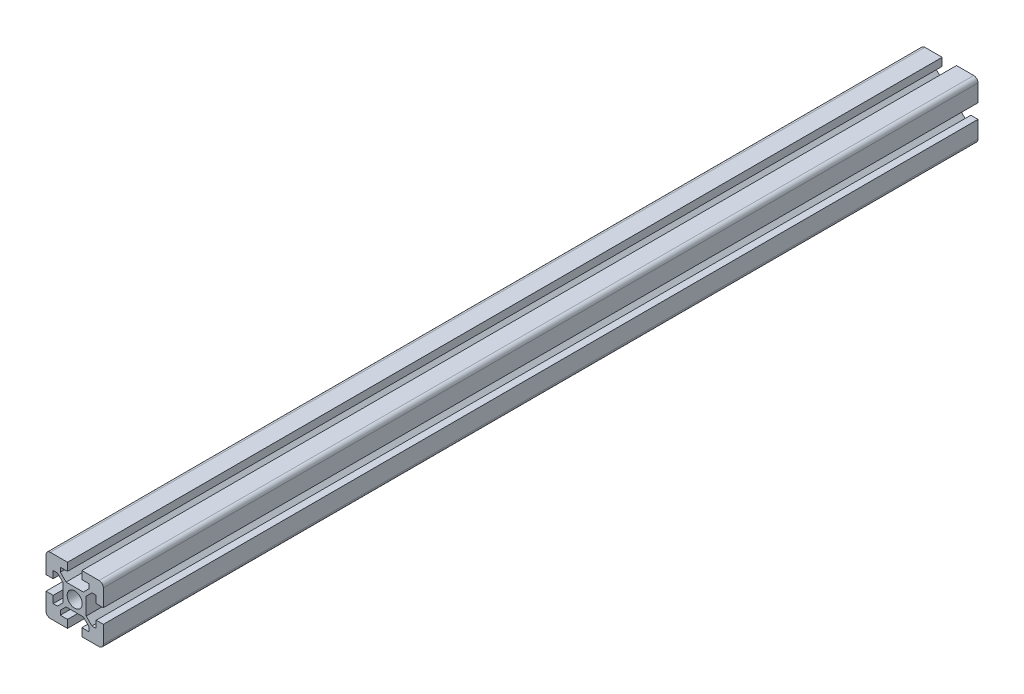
ISO-10303-21;
HEADER;
FILE_DESCRIPTION(('STEP AP214'),'2;1');
FILE_NAME('part.step','',(''),(''),'','','');
FILE_SCHEMA(('AUTOMOTIVE_DESIGN { 1 0 10303 214 1 1 1 1 }'));
ENDSEC;
DATA;
#1=APPLICATION_CONTEXT('core data for automotive mechanical design processes');
#2=APPLICATION_PROTOCOL_DEFINITION('international standard','automotive_design',2000,#1);
#3=PRODUCT_CONTEXT('',#1,'mechanical');
#4=PRODUCT('Part','Part','',(#3));
#5=PRODUCT_RELATED_PRODUCT_CATEGORY('part','',(#4));
#6=PRODUCT_DEFINITION_FORMATION('','',#4);
#7=PRODUCT_DEFINITION_CONTEXT('part definition',#1,'design');
#8=PRODUCT_DEFINITION('design','',#6,#7);
#9=PRODUCT_DEFINITION_SHAPE('','',#8);
#10=(LENGTH_UNIT() NAMED_UNIT(*) SI_UNIT(.MILLI.,.METRE.));
#11=(NAMED_UNIT(*) PLANE_ANGLE_UNIT() SI_UNIT($,.RADIAN.));
#12=(NAMED_UNIT(*) SI_UNIT($,.STERADIAN.) SOLID_ANGLE_UNIT());
#13=UNCERTAINTY_MEASURE_WITH_UNIT(LENGTH_MEASURE(1.E-05),#10,'distance_accuracy_value','');
#14=(GEOMETRIC_REPRESENTATION_CONTEXT(3) GLOBAL_UNCERTAINTY_ASSIGNED_CONTEXT((#13)) GLOBAL_UNIT_ASSIGNED_CONTEXT((#10,
#11,#12)) REPRESENTATION_CONTEXT('',''));
#15=CARTESIAN_POINT('',(0.,0.,0.));
#16=DIRECTION('',(0.,0.,1.));
#17=DIRECTION('',(1.,0.,0.));
#18=AXIS2_PLACEMENT_3D('',#15,#16,#17);
#19=CARTESIAN_POINT('',(20.,0.,610.));
#20=DIRECTION('',(0.,1.,0.));
#21=DIRECTION('',(0.,0.,1.));
#22=AXIS2_PLACEMENT_3D('',#19,#20,#21);
#23=PLANE('',#22);
#24=DIRECTION('',(1.,0.,0.));
#25=VECTOR('',#24,1.);
#26=CARTESIAN_POINT('',(20.,0.,0.));
#27=LINE('',#26,#25);
#28=CARTESIAN_POINT('',(3.00000000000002,0.,0.));
#29=VERTEX_POINT('',#28);
#30=CARTESIAN_POINT('',(15.,0.,0.));
#31=VERTEX_POINT('',#30);
#32=EDGE_CURVE('E371',#29,#31,#27,.T.);
#33=ORIENTED_EDGE('',*,*,#32,.F.);
#34=DIRECTION('',(0.,0.,-1.));
#35=VECTOR('',#34,1.);
#36=CARTESIAN_POINT('',(3.00000000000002,0.,610.));
#37=LINE('',#36,#35);
#38=CARTESIAN_POINT('',(3.00000000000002,0.,610.));
#39=VERTEX_POINT('',#38);
#40=EDGE_CURVE('E11',#39,#29,#37,.T.);
#41=ORIENTED_EDGE('',*,*,#40,.F.);
#42=DIRECTION('',(1.,0.,0.));
#43=VECTOR('',#42,1.);
#44=CARTESIAN_POINT('',(20.,0.,610.));
#45=LINE('',#44,#43);
#46=CARTESIAN_POINT('',(15.,0.,610.));
#47=VERTEX_POINT('',#46);
#48=EDGE_CURVE('E823',#39,#47,#45,.T.);
#49=ORIENTED_EDGE('',*,*,#48,.T.);
#50=DIRECTION('',(0.,0.,-1.));
#51=VECTOR('',#50,1.);
#52=CARTESIAN_POINT('',(15.,0.,610.));
#53=LINE('',#52,#51);
#54=EDGE_CURVE('E50',#47,#31,#53,.T.);
#55=ORIENTED_EDGE('',*,*,#54,.T.);
#56=EDGE_LOOP('',(#33,#41,#49,#55));
#57=FACE_BOUND('',#56,.T.);
#58=ADVANCED_FACE('F33',(#57),#23,.T.);
#59=CARTESIAN_POINT('',(3.,-3.,610.));
#60=DIRECTION('',(0.,0.,-1.));
#61=DIRECTION('',(-1.,0.,0.));
#62=AXIS2_PLACEMENT_3D('',#59,#60,#61);
#63=CYLINDRICAL_SURFACE('',#62,3.);
#64=CARTESIAN_POINT('',(3.,-3.,0.));
#65=DIRECTION('',(0.,0.,1.));
#66=DIRECTION('',(1.,0.,0.));
#67=AXIS2_PLACEMENT_3D('',#64,#65,#66);
#68=CIRCLE('',#67,3.);
#69=CARTESIAN_POINT('',(0.,-3.00000000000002,0.));
#70=VERTEX_POINT('',#69);
#71=EDGE_CURVE('E373',#29,#70,#68,.T.);
#72=ORIENTED_EDGE('',*,*,#71,.T.);
#73=DIRECTION('',(0.,0.,-1.));
#74=VECTOR('',#73,1.);
#75=CARTESIAN_POINT('',(0.,-3.00000000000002,610.));
#76=LINE('',#75,#74);
#77=CARTESIAN_POINT('',(0.,-3.00000000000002,610.));
#78=VERTEX_POINT('',#77);
#79=EDGE_CURVE('E42',#78,#70,#76,.T.);
#80=ORIENTED_EDGE('',*,*,#79,.F.);
#81=CARTESIAN_POINT('',(3.,-3.,610.));
#82=DIRECTION('',(0.,0.,1.));
#83=DIRECTION('',(1.,0.,0.));
#84=AXIS2_PLACEMENT_3D('',#81,#82,#83);
#85=CIRCLE('',#84,3.);
#86=EDGE_CURVE('E825',#39,#78,#85,.T.);
#87=ORIENTED_EDGE('',*,*,#86,.F.);
#88=ORIENTED_EDGE('',*,*,#40,.T.);
#89=EDGE_LOOP('',(#72,#80,#87,#88));
#90=FACE_BOUND('',#89,.T.);
#91=ADVANCED_FACE('F627',(#90),#63,.T.);
#92=CARTESIAN_POINT('',(0.,-64.1414213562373,610.));
#93=DIRECTION('',(1.,0.,0.));
#94=DIRECTION('',(0.,1.,0.));
#95=AXIS2_PLACEMENT_3D('',#92,#93,#94);
#96=PLANE('',#95);
#97=DIRECTION('',(0.,-1.,0.));
#98=VECTOR('',#97,1.);
#99=CARTESIAN_POINT('',(0.,-64.1414213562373,0.));
#100=LINE('',#99,#98);
#101=CARTESIAN_POINT('',(0.,-15.,0.));
#102=VERTEX_POINT('',#101);
#103=EDGE_CURVE('E376',#70,#102,#100,.T.);
#104=ORIENTED_EDGE('',*,*,#103,.T.);
#105=DIRECTION('',(0.,0.,-1.));
#106=VECTOR('',#105,1.);
#107=CARTESIAN_POINT('',(0.,-15.,610.));
#108=LINE('',#107,#106);
#109=CARTESIAN_POINT('',(0.,-15.,610.));
#110=VERTEX_POINT('',#109);
#111=EDGE_CURVE('E615',#110,#102,#108,.T.);
#112=ORIENTED_EDGE('',*,*,#111,.F.);
#113=DIRECTION('',(0.,-1.,0.));
#114=VECTOR('',#113,1.);
#115=CARTESIAN_POINT('',(0.,-64.1414213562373,610.));
#116=LINE('',#115,#114);
#117=EDGE_CURVE('E623',#78,#110,#116,.T.);
#118=ORIENTED_EDGE('',*,*,#117,.F.);
#119=ORIENTED_EDGE('',*,*,#79,.T.);
#120=EDGE_LOOP('',(#104,#112,#118,#119));
#121=FACE_BOUND('',#120,.T.);
#122=ADVANCED_FACE('F620',(#121),#96,.F.);
#123=CARTESIAN_POINT('',(20.,-15.,610.));
#124=DIRECTION('',(0.,1.,0.));
#125=DIRECTION('',(0.,0.,1.));
#126=AXIS2_PLACEMENT_3D('',#123,#124,#125);
#127=PLANE('',#126);
#128=DIRECTION('',(1.,0.,0.));
#129=VECTOR('',#128,1.);
#130=CARTESIAN_POINT('',(20.,-15.,0.));
#131=LINE('',#130,#129);
#132=CARTESIAN_POINT('',(4.99999999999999,-15.,0.));
#133=VERTEX_POINT('',#132);
#134=EDGE_CURVE('E379',#102,#133,#131,.T.);
#135=ORIENTED_EDGE('',*,*,#134,.T.);
#136=DIRECTION('',(0.,0.,-1.));
#137=VECTOR('',#136,1.);
#138=CARTESIAN_POINT('',(4.99999999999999,-15.,610.));
#139=LINE('',#138,#137);
#140=CARTESIAN_POINT('',(4.99999999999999,-15.,610.));
#141=VERTEX_POINT('',#140);
#142=EDGE_CURVE('E612',#141,#133,#139,.T.);
#143=ORIENTED_EDGE('',*,*,#142,.F.);
#144=DIRECTION('',(1.,0.,0.));
#145=VECTOR('',#144,1.);
#146=CARTESIAN_POINT('',(20.,-15.,610.));
#147=LINE('',#146,#145);
#148=EDGE_CURVE('E830',#110,#141,#147,.T.);
#149=ORIENTED_EDGE('',*,*,#148,.F.);
#150=ORIENTED_EDGE('',*,*,#111,.T.);
#151=EDGE_LOOP('',(#135,#143,#149,#150));
#152=FACE_BOUND('',#151,.T.);
#153=ADVANCED_FACE('F638',(#152),#127,.F.);
#154=CARTESIAN_POINT('',(5.,-64.1414213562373,610.));
#155=DIRECTION('',(-1.,0.,0.));
#156=DIRECTION('',(0.,-1.,0.));
#157=AXIS2_PLACEMENT_3D('',#154,#155,#156);
#158=PLANE('',#157);
#159=DIRECTION('',(0.,1.,0.));
#160=VECTOR('',#159,1.);
#161=CARTESIAN_POINT('',(5.,-64.1414213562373,0.));
#162=LINE('',#161,#160);
#163=CARTESIAN_POINT('',(4.99999999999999,-10.,0.));
#164=VERTEX_POINT('',#163);
#165=EDGE_CURVE('E382',#133,#164,#162,.T.);
#166=ORIENTED_EDGE('',*,*,#165,.T.);
#167=DIRECTION('',(0.,0.,-1.));
#168=VECTOR('',#167,1.);
#169=CARTESIAN_POINT('',(4.99999999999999,-10.,610.));
#170=LINE('',#169,#168);
#171=CARTESIAN_POINT('',(4.99999999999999,-10.,610.));
#172=VERTEX_POINT('',#171);
#173=EDGE_CURVE('E609',#172,#164,#170,.T.);
#174=ORIENTED_EDGE('',*,*,#173,.F.);
#175=DIRECTION('',(0.,1.,0.));
#176=VECTOR('',#175,1.);
#177=CARTESIAN_POINT('',(5.,-64.1414213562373,610.));
#178=LINE('',#177,#176);
#179=EDGE_CURVE('E833',#141,#172,#178,.T.);
#180=ORIENTED_EDGE('',*,*,#179,.F.);
#181=ORIENTED_EDGE('',*,*,#142,.T.);
#182=EDGE_LOOP('',(#166,#174,#180,#181));
#183=FACE_BOUND('',#182,.T.);
#184=ADVANCED_FACE('F641',(#183),#158,.F.);
#185=CARTESIAN_POINT('',(20.,-10.,610.));
#186=DIRECTION('',(0.,1.,0.));
#187=DIRECTION('',(0.,0.,1.));
#188=AXIS2_PLACEMENT_3D('',#185,#186,#187);
#189=PLANE('',#188);
#190=DIRECTION('',(1.,0.,0.));
#191=VECTOR('',#190,1.);
#192=CARTESIAN_POINT('',(20.,-10.,0.));
#193=LINE('',#192,#191);
#194=CARTESIAN_POINT('',(7.99999999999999,-10.,0.));
#195=VERTEX_POINT('',#194);
#196=EDGE_CURVE('E385',#164,#195,#193,.T.);
#197=ORIENTED_EDGE('',*,*,#196,.T.);
#198=DIRECTION('',(0.,0.,-1.));
#199=VECTOR('',#198,1.);
#200=CARTESIAN_POINT('',(7.99999999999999,-10.,610.));
#201=LINE('',#200,#199);
#202=CARTESIAN_POINT('',(7.99999999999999,-10.,610.));
#203=VERTEX_POINT('',#202);
#204=EDGE_CURVE('E606',#203,#195,#201,.T.);
#205=ORIENTED_EDGE('',*,*,#204,.F.);
#206=DIRECTION('',(1.,0.,0.));
#207=VECTOR('',#206,1.);
#208=CARTESIAN_POINT('',(20.,-10.,610.));
#209=LINE('',#208,#207);
#210=EDGE_CURVE('E836',#172,#203,#209,.T.);
#211=ORIENTED_EDGE('',*,*,#210,.F.);
#212=ORIENTED_EDGE('',*,*,#173,.T.);
#213=EDGE_LOOP('',(#197,#205,#211,#212));
#214=FACE_BOUND('',#213,.T.);
#215=ADVANCED_FACE('F645',(#214),#189,.F.);
#216=CARTESIAN_POINT('',(41.0707106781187,-43.0707106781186,610.));
#217=DIRECTION('',(0.707106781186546,0.707106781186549,0.));
#218=DIRECTION('',(-0.707106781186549,0.707106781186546,0.));
#219=AXIS2_PLACEMENT_3D('',#216,#217,#218);
#220=PLANE('',#219);
#221=DIRECTION('',(0.707106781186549,-0.707106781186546,0.));
#222=VECTOR('',#221,1.);
#223=CARTESIAN_POINT('',(41.0707106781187,-43.0707106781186,0.));
#224=LINE('',#223,#222);
#225=CARTESIAN_POINT('',(12.,-14.,0.));
#226=VERTEX_POINT('',#225);
#227=EDGE_CURVE('E388',#195,#226,#224,.T.);
#228=ORIENTED_EDGE('',*,*,#227,.T.);
#229=DIRECTION('',(0.,0.,-1.));
#230=VECTOR('',#229,1.);
#231=CARTESIAN_POINT('',(12.,-14.,610.));
#232=LINE('',#231,#230);
#233=CARTESIAN_POINT('',(12.,-14.,610.));
#234=VERTEX_POINT('',#233);
#235=EDGE_CURVE('E603',#234,#226,#232,.T.);
#236=ORIENTED_EDGE('',*,*,#235,.F.);
#237=DIRECTION('',(0.707106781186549,-0.707106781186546,0.));
#238=VECTOR('',#237,1.);
#239=CARTESIAN_POINT('',(41.0707106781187,-43.0707106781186,610.));
#240=LINE('',#239,#238);
#241=EDGE_CURVE('E839',#203,#234,#240,.T.);
#242=ORIENTED_EDGE('',*,*,#241,.F.);
#243=ORIENTED_EDGE('',*,*,#204,.T.);
#244=EDGE_LOOP('',(#228,#236,#242,#243));
#245=FACE_BOUND('',#244,.T.);
#246=ADVANCED_FACE('F649',(#245),#220,.F.);
#247=CARTESIAN_POINT('',(12.,-64.1414213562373,610.));
#248=DIRECTION('',(1.,0.,0.));
#249=DIRECTION('',(0.,1.,0.));
#250=AXIS2_PLACEMENT_3D('',#247,#248,#249);
#251=PLANE('',#250);
#252=DIRECTION('',(0.,-1.,0.));
#253=VECTOR('',#252,1.);
#254=CARTESIAN_POINT('',(12.,-64.1414213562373,0.));
#255=LINE('',#254,#253);
#256=CARTESIAN_POINT('',(12.,-26.,0.));
#257=VERTEX_POINT('',#256);
#258=EDGE_CURVE('E391',#226,#257,#255,.T.);
#259=ORIENTED_EDGE('',*,*,#258,.T.);
#260=DIRECTION('',(0.,0.,-1.));
#261=VECTOR('',#260,1.);
#262=CARTESIAN_POINT('',(12.,-26.,610.));
#263=LINE('',#262,#261);
#264=CARTESIAN_POINT('',(12.,-26.,610.));
#265=VERTEX_POINT('',#264);
#266=EDGE_CURVE('E600',#265,#257,#263,.T.);
#267=ORIENTED_EDGE('',*,*,#266,.F.);
#268=DIRECTION('',(0.,-1.,0.));
#269=VECTOR('',#268,1.);
#270=CARTESIAN_POINT('',(12.,-64.1414213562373,610.));
#271=LINE('',#270,#269);
#272=EDGE_CURVE('E842',#234,#265,#271,.T.);
#273=ORIENTED_EDGE('',*,*,#272,.F.);
#274=ORIENTED_EDGE('',*,*,#235,.T.);
#275=EDGE_LOOP('',(#259,#267,#273,#274));
#276=FACE_BOUND('',#275,.T.);
#277=ADVANCED_FACE('F653',(#276),#251,.F.);
#278=CARTESIAN_POINT('',(-3.07071067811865,-41.0707106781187,610.));
#279=DIRECTION('',(0.707106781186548,-0.707106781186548,0.));
#280=DIRECTION('',(0.707106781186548,0.707106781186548,0.));
#281=AXIS2_PLACEMENT_3D('',#278,#279,#280);
#282=PLANE('',#281);
#283=DIRECTION('',(-0.707106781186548,-0.707106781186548,0.));
#284=VECTOR('',#283,1.);
#285=CARTESIAN_POINT('',(-3.07071067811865,-41.0707106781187,0.));
#286=LINE('',#285,#284);
#287=CARTESIAN_POINT('',(8.00000000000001,-30.,0.));
#288=VERTEX_POINT('',#287);
#289=EDGE_CURVE('E394',#257,#288,#286,.T.);
#290=ORIENTED_EDGE('',*,*,#289,.T.);
#291=DIRECTION('',(0.,0.,-1.));
#292=VECTOR('',#291,1.);
#293=CARTESIAN_POINT('',(8.00000000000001,-30.,610.));
#294=LINE('',#293,#292);
#295=CARTESIAN_POINT('',(8.00000000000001,-30.,610.));
#296=VERTEX_POINT('',#295);
#297=EDGE_CURVE('E597',#296,#288,#294,.T.);
#298=ORIENTED_EDGE('',*,*,#297,.F.);
#299=DIRECTION('',(-0.707106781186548,-0.707106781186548,0.));
#300=VECTOR('',#299,1.);
#301=CARTESIAN_POINT('',(-3.07071067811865,-41.0707106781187,610.));
#302=LINE('',#301,#300);
#303=EDGE_CURVE('E845',#265,#296,#302,.T.);
#304=ORIENTED_EDGE('',*,*,#303,.F.);
#305=ORIENTED_EDGE('',*,*,#266,.T.);
#306=EDGE_LOOP('',(#290,#298,#304,#305));
#307=FACE_BOUND('',#306,.T.);
#308=ADVANCED_FACE('F657',(#307),#282,.F.);
#309=CARTESIAN_POINT('',(20.,-30.,610.));
#310=DIRECTION('',(0.,-1.,0.));
#311=DIRECTION('',(0.,0.,-1.));
#312=AXIS2_PLACEMENT_3D('',#309,#310,#311);
#313=PLANE('',#312);
#314=DIRECTION('',(-1.,0.,0.));
#315=VECTOR('',#314,1.);
#316=CARTESIAN_POINT('',(20.,-30.,0.));
#317=LINE('',#316,#315);
#318=CARTESIAN_POINT('',(5.,-30.,0.));
#319=VERTEX_POINT('',#318);
#320=EDGE_CURVE('E397',#288,#319,#317,.T.);
#321=ORIENTED_EDGE('',*,*,#320,.T.);
#322=DIRECTION('',(0.,0.,-1.));
#323=VECTOR('',#322,1.);
#324=CARTESIAN_POINT('',(5.,-30.,610.));
#325=LINE('',#324,#323);
#326=CARTESIAN_POINT('',(5.,-30.,610.));
#327=VERTEX_POINT('',#326);
#328=EDGE_CURVE('E594',#327,#319,#325,.T.);
#329=ORIENTED_EDGE('',*,*,#328,.F.);
#330=DIRECTION('',(-1.,0.,0.));
#331=VECTOR('',#330,1.);
#332=CARTESIAN_POINT('',(20.,-30.,610.));
#333=LINE('',#332,#331);
#334=EDGE_CURVE('E848',#296,#327,#333,.T.);
#335=ORIENTED_EDGE('',*,*,#334,.F.);
#336=ORIENTED_EDGE('',*,*,#297,.T.);
#337=EDGE_LOOP('',(#321,#329,#335,#336));
#338=FACE_BOUND('',#337,.T.);
#339=ADVANCED_FACE('F661',(#338),#313,.F.);
#340=CARTESIAN_POINT('',(5.,-64.1414213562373,610.));
#341=DIRECTION('',(-1.,0.,0.));
#342=DIRECTION('',(0.,0.,1.));
#343=AXIS2_PLACEMENT_3D('',#340,#341,#342);
#344=PLANE('',#343);
#345=DIRECTION('',(0.,1.,0.));
#346=VECTOR('',#345,1.);
#347=CARTESIAN_POINT('',(5.,-64.1414213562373,0.));
#348=LINE('',#347,#346);
#349=CARTESIAN_POINT('',(5.,-25.,0.));
#350=VERTEX_POINT('',#349);
#351=EDGE_CURVE('E400',#319,#350,#348,.T.);
#352=ORIENTED_EDGE('',*,*,#351,.T.);
#353=DIRECTION('',(0.,0.,-1.));
#354=VECTOR('',#353,1.);
#355=CARTESIAN_POINT('',(5.,-25.,610.));
#356=LINE('',#355,#354);
#357=CARTESIAN_POINT('',(5.,-25.,610.));
#358=VERTEX_POINT('',#357);
#359=EDGE_CURVE('E592',#358,#350,#356,.T.);
#360=ORIENTED_EDGE('',*,*,#359,.F.);
#361=DIRECTION('',(0.,1.,0.));
#362=VECTOR('',#361,1.);
#363=CARTESIAN_POINT('',(5.,-64.1414213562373,610.));
#364=LINE('',#363,#362);
#365=EDGE_CURVE('E851',#327,#358,#364,.T.);
#366=ORIENTED_EDGE('',*,*,#365,.F.);
#367=ORIENTED_EDGE('',*,*,#328,.T.);
#368=EDGE_LOOP('',(#352,#360,#366,#367));
#369=FACE_BOUND('',#368,.T.);
#370=ADVANCED_FACE('F665',(#369),#344,.F.);
#371=CARTESIAN_POINT('',(20.,-25.,610.));
#372=DIRECTION('',(0.,1.,0.));
#373=DIRECTION('',(0.,0.,1.));
#374=AXIS2_PLACEMENT_3D('',#371,#372,#373);
#375=PLANE('',#374);
#376=DIRECTION('',(1.,0.,0.));
#377=VECTOR('',#376,1.);
#378=CARTESIAN_POINT('',(20.,-25.,0.));
#379=LINE('',#378,#377);
#380=CARTESIAN_POINT('',(0.,-25.,0.));
#381=VERTEX_POINT('',#380);
#382=EDGE_CURVE('E403',#381,#350,#379,.T.);
#383=ORIENTED_EDGE('',*,*,#382,.F.);
#384=DIRECTION('',(0.,0.,-1.));
#385=VECTOR('',#384,1.);
#386=CARTESIAN_POINT('',(0.,-25.,610.));
#387=LINE('',#386,#385);
#388=CARTESIAN_POINT('',(0.,-25.,610.));
#389=VERTEX_POINT('',#388);
#390=EDGE_CURVE('E590',#389,#381,#387,.T.);
#391=ORIENTED_EDGE('',*,*,#390,.F.);
#392=DIRECTION('',(1.,0.,0.));
#393=VECTOR('',#392,1.);
#394=CARTESIAN_POINT('',(20.,-25.,610.));
#395=LINE('',#394,#393);
#396=EDGE_CURVE('E853',#389,#358,#395,.T.);
#397=ORIENTED_EDGE('',*,*,#396,.T.);
#398=ORIENTED_EDGE('',*,*,#359,.T.);
#399=EDGE_LOOP('',(#383,#391,#397,#398));
#400=FACE_BOUND('',#399,.T.);
#401=ADVANCED_FACE('F669',(#400),#375,.T.);
#402=CARTESIAN_POINT('',(0.,-64.1414213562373,610.));
#403=DIRECTION('',(1.,0.,0.));
#404=DIRECTION('',(0.,1.,0.));
#405=AXIS2_PLACEMENT_3D('',#402,#403,#404);
#406=PLANE('',#405);
#407=DIRECTION('',(0.,-1.,0.));
#408=VECTOR('',#407,1.);
#409=CARTESIAN_POINT('',(0.,-64.1414213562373,0.));
#410=LINE('',#409,#408);
#411=CARTESIAN_POINT('',(0.,-37.,0.));
#412=VERTEX_POINT('',#411);
#413=EDGE_CURVE('E406',#381,#412,#410,.T.);
#414=ORIENTED_EDGE('',*,*,#413,.T.);
#415=DIRECTION('',(0.,0.,-1.));
#416=VECTOR('',#415,1.);
#417=CARTESIAN_POINT('',(0.,-37.,610.));
#418=LINE('',#417,#416);
#419=CARTESIAN_POINT('',(0.,-37.,610.));
#420=VERTEX_POINT('',#419);
#421=EDGE_CURVE('E587',#420,#412,#418,.T.);
#422=ORIENTED_EDGE('',*,*,#421,.F.);
#423=DIRECTION('',(0.,-1.,0.));
#424=VECTOR('',#423,1.);
#425=CARTESIAN_POINT('',(0.,-64.1414213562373,610.));
#426=LINE('',#425,#424);
#427=EDGE_CURVE('E856',#389,#420,#426,.T.);
#428=ORIENTED_EDGE('',*,*,#427,.F.);
#429=ORIENTED_EDGE('',*,*,#390,.T.);
#430=EDGE_LOOP('',(#414,#422,#428,#429));
#431=FACE_BOUND('',#430,.T.);
#432=ADVANCED_FACE('F673',(#431),#406,.F.);
#433=CARTESIAN_POINT('',(3.,-37.,610.));
#434=DIRECTION('',(0.,0.,-1.));
#435=DIRECTION('',(-1.,0.,0.));
#436=AXIS2_PLACEMENT_3D('',#433,#434,#435);
#437=CYLINDRICAL_SURFACE('',#436,3.);
#438=CARTESIAN_POINT('',(3.,-37.,0.));
#439=DIRECTION('',(0.,0.,1.));
#440=DIRECTION('',(1.,0.,0.));
#441=AXIS2_PLACEMENT_3D('',#438,#439,#440);
#442=CIRCLE('',#441,3.);
#443=CARTESIAN_POINT('',(3.00000000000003,-40.,0.));
#444=VERTEX_POINT('',#443);
#445=EDGE_CURVE('E409',#412,#444,#442,.T.);
#446=ORIENTED_EDGE('',*,*,#445,.T.);
#447=DIRECTION('',(0.,0.,-1.));
#448=VECTOR('',#447,1.);
#449=CARTESIAN_POINT('',(3.00000000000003,-40.,610.));
#450=LINE('',#449,#448);
#451=CARTESIAN_POINT('',(3.00000000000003,-40.,610.));
#452=VERTEX_POINT('',#451);
#453=EDGE_CURVE('E584',#452,#444,#450,.T.);
#454=ORIENTED_EDGE('',*,*,#453,.F.);
#455=CARTESIAN_POINT('',(3.,-37.,610.));
#456=DIRECTION('',(0.,0.,1.));
#457=DIRECTION('',(1.,0.,0.));
#458=AXIS2_PLACEMENT_3D('',#455,#456,#457);
#459=CIRCLE('',#458,3.);
#460=EDGE_CURVE('E859',#420,#452,#459,.T.);
#461=ORIENTED_EDGE('',*,*,#460,.F.);
#462=ORIENTED_EDGE('',*,*,#421,.T.);
#463=EDGE_LOOP('',(#446,#454,#461,#462));
#464=FACE_BOUND('',#463,.T.);
#465=ADVANCED_FACE('F677',(#464),#437,.T.);
#466=CARTESIAN_POINT('',(20.,-40.,610.));
#467=DIRECTION('',(0.,1.,0.));
#468=DIRECTION('',(0.,0.,1.));
#469=AXIS2_PLACEMENT_3D('',#466,#467,#468);
#470=PLANE('',#469);
#471=DIRECTION('',(1.,0.,0.));
#472=VECTOR('',#471,1.);
#473=CARTESIAN_POINT('',(20.,-40.,0.));
#474=LINE('',#473,#472);
#475=CARTESIAN_POINT('',(15.,-40.,0.));
#476=VERTEX_POINT('',#475);
#477=EDGE_CURVE('E412',#444,#476,#474,.T.);
#478=ORIENTED_EDGE('',*,*,#477,.T.);
#479=DIRECTION('',(0.,0.,-1.));
#480=VECTOR('',#479,1.);
#481=CARTESIAN_POINT('',(15.,-40.,610.));
#482=LINE('',#481,#480);
#483=CARTESIAN_POINT('',(15.,-40.,610.));
#484=VERTEX_POINT('',#483);
#485=EDGE_CURVE('E581',#484,#476,#482,.T.);
#486=ORIENTED_EDGE('',*,*,#485,.F.);
#487=DIRECTION('',(1.,0.,0.));
#488=VECTOR('',#487,1.);
#489=CARTESIAN_POINT('',(20.,-40.,610.));
#490=LINE('',#489,#488);
#491=EDGE_CURVE('E862',#452,#484,#490,.T.);
#492=ORIENTED_EDGE('',*,*,#491,.F.);
#493=ORIENTED_EDGE('',*,*,#453,.T.);
#494=EDGE_LOOP('',(#478,#486,#492,#493));
#495=FACE_BOUND('',#494,.T.);
#496=ADVANCED_FACE('F681',(#495),#470,.F.);
#497=CARTESIAN_POINT('',(15.,-64.1414213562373,610.));
#498=DIRECTION('',(-1.,0.,0.));
#499=DIRECTION('',(0.,-1.,0.));
#500=AXIS2_PLACEMENT_3D('',#497,#498,#499);
#501=PLANE('',#500);
#502=DIRECTION('',(0.,1.,0.));
#503=VECTOR('',#502,1.);
#504=CARTESIAN_POINT('',(15.,-64.1414213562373,0.));
#505=LINE('',#504,#503);
#506=CARTESIAN_POINT('',(15.,-34.5,0.));
#507=VERTEX_POINT('',#506);
#508=EDGE_CURVE('E415',#476,#507,#505,.T.);
#509=ORIENTED_EDGE('',*,*,#508,.T.);
#510=DIRECTION('',(0.,0.,-1.));
#511=VECTOR('',#510,1.);
#512=CARTESIAN_POINT('',(15.,-34.5,610.));
#513=LINE('',#512,#511);
#514=CARTESIAN_POINT('',(15.,-34.5,610.));
#515=VERTEX_POINT('',#514);
#516=EDGE_CURVE('E578',#515,#507,#513,.T.);
#517=ORIENTED_EDGE('',*,*,#516,.F.);
#518=DIRECTION('',(0.,1.,0.));
#519=VECTOR('',#518,1.);
#520=CARTESIAN_POINT('',(15.,-64.1414213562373,610.));
#521=LINE('',#520,#519);
#522=EDGE_CURVE('E865',#484,#515,#521,.T.);
#523=ORIENTED_EDGE('',*,*,#522,.F.);
#524=ORIENTED_EDGE('',*,*,#485,.T.);
#525=EDGE_LOOP('',(#509,#517,#523,#524));
#526=FACE_BOUND('',#525,.T.);
#527=ADVANCED_FACE('F685',(#526),#501,.F.);
#528=CARTESIAN_POINT('',(20.,-34.5,610.));
#529=DIRECTION('',(0.,-1.,0.));
#530=DIRECTION('',(0.,0.,-1.));
#531=AXIS2_PLACEMENT_3D('',#528,#529,#530);
#532=PLANE('',#531);
#533=DIRECTION('',(-1.,0.,0.));
#534=VECTOR('',#533,1.);
#535=CARTESIAN_POINT('',(20.,-34.5,0.));
#536=LINE('',#535,#534);
#537=CARTESIAN_POINT('',(10.,-34.5,0.));
#538=VERTEX_POINT('',#537);
#539=EDGE_CURVE('E418',#507,#538,#536,.T.);
#540=ORIENTED_EDGE('',*,*,#539,.T.);
#541=DIRECTION('',(0.,0.,-1.));
#542=VECTOR('',#541,1.);
#543=CARTESIAN_POINT('',(10.,-34.5,610.));
#544=LINE('',#543,#542);
#545=CARTESIAN_POINT('',(10.,-34.5,610.));
#546=VERTEX_POINT('',#545);
#547=EDGE_CURVE('E575',#546,#538,#544,.T.);
#548=ORIENTED_EDGE('',*,*,#547,.F.);
#549=DIRECTION('',(-1.,0.,0.));
#550=VECTOR('',#549,1.);
#551=CARTESIAN_POINT('',(20.,-34.5,610.));
#552=LINE('',#551,#550);
#553=EDGE_CURVE('E868',#515,#546,#552,.T.);
#554=ORIENTED_EDGE('',*,*,#553,.F.);
#555=ORIENTED_EDGE('',*,*,#516,.T.);
#556=EDGE_LOOP('',(#540,#548,#554,#555));
#557=FACE_BOUND('',#556,.T.);
#558=ADVANCED_FACE('F689',(#557),#532,.F.);
#559=CARTESIAN_POINT('',(10.,-64.1414213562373,610.));
#560=DIRECTION('',(-1.,0.,0.));
#561=DIRECTION('',(0.,0.,1.));
#562=AXIS2_PLACEMENT_3D('',#559,#560,#561);
#563=PLANE('',#562);
#564=DIRECTION('',(0.,1.,0.));
#565=VECTOR('',#564,1.);
#566=CARTESIAN_POINT('',(10.,-64.1414213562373,0.));
#567=LINE('',#566,#565);
#568=CARTESIAN_POINT('',(10.,-31.5,0.));
#569=VERTEX_POINT('',#568);
#570=EDGE_CURVE('E421',#538,#569,#567,.T.);
#571=ORIENTED_EDGE('',*,*,#570,.T.);
#572=DIRECTION('',(0.,0.,-1.));
#573=VECTOR('',#572,1.);
#574=CARTESIAN_POINT('',(10.,-31.5,610.));
#575=LINE('',#574,#573);
#576=CARTESIAN_POINT('',(10.,-31.5,610.));
#577=VERTEX_POINT('',#576);
#578=EDGE_CURVE('E572',#577,#569,#575,.T.);
#579=ORIENTED_EDGE('',*,*,#578,.F.);
#580=DIRECTION('',(0.,1.,0.));
#581=VECTOR('',#580,1.);
#582=CARTESIAN_POINT('',(10.,-64.1414213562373,610.));
#583=LINE('',#582,#581);
#584=EDGE_CURVE('E871',#546,#577,#583,.T.);
#585=ORIENTED_EDGE('',*,*,#584,.F.);
#586=ORIENTED_EDGE('',*,*,#547,.T.);
#587=EDGE_LOOP('',(#571,#579,#585,#586));
#588=FACE_BOUND('',#587,.T.);
#589=ADVANCED_FACE('F693',(#588),#563,.F.);
#590=CARTESIAN_POINT('',(-1.32071067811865,-42.8207106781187,610.));
#591=DIRECTION('',(-0.707106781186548,0.707106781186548,0.));
#592=DIRECTION('',(-0.707106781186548,-0.707106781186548,0.));
#593=AXIS2_PLACEMENT_3D('',#590,#591,#592);
#594=PLANE('',#593);
#595=DIRECTION('',(0.707106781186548,0.707106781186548,0.));
#596=VECTOR('',#595,1.);
#597=CARTESIAN_POINT('',(-1.32071067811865,-42.8207106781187,0.));
#598=LINE('',#597,#596);
#599=CARTESIAN_POINT('',(14.,-27.5,0.));
#600=VERTEX_POINT('',#599);
#601=EDGE_CURVE('E424',#569,#600,#598,.T.);
#602=ORIENTED_EDGE('',*,*,#601,.T.);
#603=DIRECTION('',(0.,0.,-1.));
#604=VECTOR('',#603,1.);
#605=CARTESIAN_POINT('',(14.,-27.5,610.));
#606=LINE('',#605,#604);
#607=CARTESIAN_POINT('',(14.,-27.5,610.));
#608=VERTEX_POINT('',#607);
#609=EDGE_CURVE('E569',#608,#600,#606,.T.);
#610=ORIENTED_EDGE('',*,*,#609,.F.);
#611=DIRECTION('',(0.707106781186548,0.707106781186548,0.));
#612=VECTOR('',#611,1.);
#613=CARTESIAN_POINT('',(-1.32071067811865,-42.8207106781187,610.));
#614=LINE('',#613,#612);
#615=EDGE_CURVE('E874',#577,#608,#614,.T.);
#616=ORIENTED_EDGE('',*,*,#615,.F.);
#617=ORIENTED_EDGE('',*,*,#578,.T.);
#618=EDGE_LOOP('',(#602,#610,#616,#617));
#619=FACE_BOUND('',#618,.T.);
#620=ADVANCED_FACE('F697',(#619),#594,.F.);
#621=CARTESIAN_POINT('',(20.,-27.5,610.));
#622=DIRECTION('',(0.,1.,0.));
#623=DIRECTION('',(0.,0.,1.));
#624=AXIS2_PLACEMENT_3D('',#621,#622,#623);
#625=PLANE('',#624);
#626=DIRECTION('',(1.,0.,0.));
#627=VECTOR('',#626,1.);
#628=CARTESIAN_POINT('',(20.,-27.5,0.));
#629=LINE('',#628,#627);
#630=CARTESIAN_POINT('',(26.,-27.5,0.));
#631=VERTEX_POINT('',#630);
#632=EDGE_CURVE('E427',#600,#631,#629,.T.);
#633=ORIENTED_EDGE('',*,*,#632,.T.);
#634=DIRECTION('',(0.,0.,-1.));
#635=VECTOR('',#634,1.);
#636=CARTESIAN_POINT('',(26.,-27.5,610.));
#637=LINE('',#636,#635);
#638=CARTESIAN_POINT('',(26.,-27.5,610.));
#639=VERTEX_POINT('',#638);
#640=EDGE_CURVE('E566',#639,#631,#637,.T.);
#641=ORIENTED_EDGE('',*,*,#640,.F.);
#642=DIRECTION('',(1.,0.,0.));
#643=VECTOR('',#642,1.);
#644=CARTESIAN_POINT('',(20.,-27.5,610.));
#645=LINE('',#644,#643);
#646=EDGE_CURVE('E877',#608,#639,#645,.T.);
#647=ORIENTED_EDGE('',*,*,#646,.F.);
#648=ORIENTED_EDGE('',*,*,#609,.T.);
#649=EDGE_LOOP('',(#633,#641,#647,#648));
#650=FACE_BOUND('',#649,.T.);
#651=ADVANCED_FACE('F701',(#650),#625,.F.);
#652=CARTESIAN_POINT('',(41.3207106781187,-42.8207106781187,610.));
#653=DIRECTION('',(0.707106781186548,0.707106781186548,0.));
#654=DIRECTION('',(-0.707106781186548,0.707106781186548,0.));
#655=AXIS2_PLACEMENT_3D('',#652,#653,#654);
#656=PLANE('',#655);
#657=DIRECTION('',(0.707106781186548,-0.707106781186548,0.));
#658=VECTOR('',#657,1.);
#659=CARTESIAN_POINT('',(41.3207106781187,-42.8207106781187,0.));
#660=LINE('',#659,#658);
#661=CARTESIAN_POINT('',(30.,-31.5,0.));
#662=VERTEX_POINT('',#661);
#663=EDGE_CURVE('E430',#631,#662,#660,.T.);
#664=ORIENTED_EDGE('',*,*,#663,.T.);
#665=DIRECTION('',(0.,0.,-1.));
#666=VECTOR('',#665,1.);
#667=CARTESIAN_POINT('',(30.,-31.5,610.));
#668=LINE('',#667,#666);
#669=CARTESIAN_POINT('',(30.,-31.5,610.));
#670=VERTEX_POINT('',#669);
#671=EDGE_CURVE('E563',#670,#662,#668,.T.);
#672=ORIENTED_EDGE('',*,*,#671,.F.);
#673=DIRECTION('',(0.707106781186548,-0.707106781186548,0.));
#674=VECTOR('',#673,1.);
#675=CARTESIAN_POINT('',(41.3207106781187,-42.8207106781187,610.));
#676=LINE('',#675,#674);
#677=EDGE_CURVE('E880',#639,#670,#676,.T.);
#678=ORIENTED_EDGE('',*,*,#677,.F.);
#679=ORIENTED_EDGE('',*,*,#640,.T.);
#680=EDGE_LOOP('',(#664,#672,#678,#679));
#681=FACE_BOUND('',#680,.T.);
#682=ADVANCED_FACE('F705',(#681),#656,.F.);
#683=CARTESIAN_POINT('',(30.,-64.1414213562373,610.));
#684=DIRECTION('',(1.,0.,0.));
#685=DIRECTION('',(0.,0.,-1.));
#686=AXIS2_PLACEMENT_3D('',#683,#684,#685);
#687=PLANE('',#686);
#688=DIRECTION('',(0.,-1.,0.));
#689=VECTOR('',#688,1.);
#690=CARTESIAN_POINT('',(30.,-64.1414213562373,0.));
#691=LINE('',#690,#689);
#692=CARTESIAN_POINT('',(30.,-34.5,0.));
#693=VERTEX_POINT('',#692);
#694=EDGE_CURVE('E433',#662,#693,#691,.T.);
#695=ORIENTED_EDGE('',*,*,#694,.T.);
#696=DIRECTION('',(0.,0.,-1.));
#697=VECTOR('',#696,1.);
#698=CARTESIAN_POINT('',(30.,-34.5,610.));
#699=LINE('',#698,#697);
#700=CARTESIAN_POINT('',(30.,-34.5,610.));
#701=VERTEX_POINT('',#700);
#702=EDGE_CURVE('E560',#701,#693,#699,.T.);
#703=ORIENTED_EDGE('',*,*,#702,.F.);
#704=DIRECTION('',(0.,-1.,0.));
#705=VECTOR('',#704,1.);
#706=CARTESIAN_POINT('',(30.,-64.1414213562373,610.));
#707=LINE('',#706,#705);
#708=EDGE_CURVE('E883',#670,#701,#707,.T.);
#709=ORIENTED_EDGE('',*,*,#708,.F.);
#710=ORIENTED_EDGE('',*,*,#671,.T.);
#711=EDGE_LOOP('',(#695,#703,#709,#710));
#712=FACE_BOUND('',#711,.T.);
#713=ADVANCED_FACE('F709',(#712),#687,.F.);
#714=CARTESIAN_POINT('',(20.,-34.5,610.));
#715=DIRECTION('',(0.,-1.,0.));
#716=DIRECTION('',(1.,0.,0.));
#717=AXIS2_PLACEMENT_3D('',#714,#715,#716);
#718=PLANE('',#717);
#719=DIRECTION('',(-1.,0.,0.));
#720=VECTOR('',#719,1.);
#721=CARTESIAN_POINT('',(20.,-34.5,0.));
#722=LINE('',#721,#720);
#723=CARTESIAN_POINT('',(25.,-34.5,0.));
#724=VERTEX_POINT('',#723);
#725=EDGE_CURVE('E436',#693,#724,#722,.T.);
#726=ORIENTED_EDGE('',*,*,#725,.T.);
#727=DIRECTION('',(0.,0.,-1.));
#728=VECTOR('',#727,1.);
#729=CARTESIAN_POINT('',(25.,-34.5,610.));
#730=LINE('',#729,#728);
#731=CARTESIAN_POINT('',(25.,-34.5,610.));
#732=VERTEX_POINT('',#731);
#733=EDGE_CURVE('E558',#732,#724,#730,.T.);
#734=ORIENTED_EDGE('',*,*,#733,.F.);
#735=DIRECTION('',(-1.,0.,0.));
#736=VECTOR('',#735,1.);
#737=CARTESIAN_POINT('',(20.,-34.5,610.));
#738=LINE('',#737,#736);
#739=EDGE_CURVE('E886',#701,#732,#738,.T.);
#740=ORIENTED_EDGE('',*,*,#739,.F.);
#741=ORIENTED_EDGE('',*,*,#702,.T.);
#742=EDGE_LOOP('',(#726,#734,#740,#741));
#743=FACE_BOUND('',#742,.T.);
#744=ADVANCED_FACE('F713',(#743),#718,.F.);
#745=CARTESIAN_POINT('',(25.,-64.1414213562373,610.));
#746=DIRECTION('',(-1.,0.,0.));
#747=DIRECTION('',(0.,0.,1.));
#748=AXIS2_PLACEMENT_3D('',#745,#746,#747);
#749=PLANE('',#748);
#750=DIRECTION('',(0.,1.,0.));
#751=VECTOR('',#750,1.);
#752=CARTESIAN_POINT('',(25.,-64.1414213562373,0.));
#753=LINE('',#752,#751);
#754=CARTESIAN_POINT('',(25.,-40.,0.));
#755=VERTEX_POINT('',#754);
#756=EDGE_CURVE('E439',#755,#724,#753,.T.);
#757=ORIENTED_EDGE('',*,*,#756,.F.);
#758=DIRECTION('',(0.,0.,-1.));
#759=VECTOR('',#758,1.);
#760=CARTESIAN_POINT('',(25.,-40.,610.));
#761=LINE('',#760,#759);
#762=CARTESIAN_POINT('',(25.,-40.,610.));
#763=VERTEX_POINT('',#762);
#764=EDGE_CURVE('E556',#763,#755,#761,.T.);
#765=ORIENTED_EDGE('',*,*,#764,.F.);
#766=DIRECTION('',(0.,1.,0.));
#767=VECTOR('',#766,1.);
#768=CARTESIAN_POINT('',(25.,-64.1414213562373,610.));
#769=LINE('',#768,#767);
#770=EDGE_CURVE('E888',#763,#732,#769,.T.);
#771=ORIENTED_EDGE('',*,*,#770,.T.);
#772=ORIENTED_EDGE('',*,*,#733,.T.);
#773=EDGE_LOOP('',(#757,#765,#771,#772));
#774=FACE_BOUND('',#773,.T.);
#775=ADVANCED_FACE('F717',(#774),#749,.T.);
#776=CARTESIAN_POINT('',(20.,-40.,610.));
#777=DIRECTION('',(0.,1.,0.));
#778=DIRECTION('',(0.,0.,1.));
#779=AXIS2_PLACEMENT_3D('',#776,#777,#778);
#780=PLANE('',#779);
#781=DIRECTION('',(1.,0.,0.));
#782=VECTOR('',#781,1.);
#783=CARTESIAN_POINT('',(20.,-40.,0.));
#784=LINE('',#783,#782);
#785=CARTESIAN_POINT('',(37.,-40.,0.));
#786=VERTEX_POINT('',#785);
#787=EDGE_CURVE('E442',#755,#786,#784,.T.);
#788=ORIENTED_EDGE('',*,*,#787,.T.);
#789=DIRECTION('',(0.,0.,-1.));
#790=VECTOR('',#789,1.);
#791=CARTESIAN_POINT('',(37.,-40.,610.));
#792=LINE('',#791,#790);
#793=CARTESIAN_POINT('',(37.,-40.,610.));
#794=VERTEX_POINT('',#793);
#795=EDGE_CURVE('E553',#794,#786,#792,.T.);
#796=ORIENTED_EDGE('',*,*,#795,.F.);
#797=DIRECTION('',(1.,0.,0.));
#798=VECTOR('',#797,1.);
#799=CARTESIAN_POINT('',(20.,-40.,610.));
#800=LINE('',#799,#798);
#801=EDGE_CURVE('E891',#763,#794,#800,.T.);
#802=ORIENTED_EDGE('',*,*,#801,.F.);
#803=ORIENTED_EDGE('',*,*,#764,.T.);
#804=EDGE_LOOP('',(#788,#796,#802,#803));
#805=FACE_BOUND('',#804,.T.);
#806=ADVANCED_FACE('F721',(#805),#780,.F.);
#807=CARTESIAN_POINT('',(37.,-37.,610.));
#808=DIRECTION('',(0.,0.,-1.));
#809=DIRECTION('',(-1.,0.,0.));
#810=AXIS2_PLACEMENT_3D('',#807,#808,#809);
#811=CYLINDRICAL_SURFACE('',#810,3.);
#812=CARTESIAN_POINT('',(37.,-37.,0.));
#813=DIRECTION('',(0.,0.,1.));
#814=DIRECTION('',(1.,0.,0.));
#815=AXIS2_PLACEMENT_3D('',#812,#813,#814);
#816=CIRCLE('',#815,3.);
#817=CARTESIAN_POINT('',(40.,-37.,0.));
#818=VERTEX_POINT('',#817);
#819=EDGE_CURVE('E445',#786,#818,#816,.T.);
#820=ORIENTED_EDGE('',*,*,#819,.T.);
#821=DIRECTION('',(0.,0.,-1.));
#822=VECTOR('',#821,1.);
#823=CARTESIAN_POINT('',(40.,-37.,610.));
#824=LINE('',#823,#822);
#825=CARTESIAN_POINT('',(40.,-37.,610.));
#826=VERTEX_POINT('',#825);
#827=EDGE_CURVE('E551',#826,#818,#824,.T.);
#828=ORIENTED_EDGE('',*,*,#827,.F.);
#829=CARTESIAN_POINT('',(37.,-37.,610.));
#830=DIRECTION('',(0.,0.,1.));
#831=DIRECTION('',(1.,0.,0.));
#832=AXIS2_PLACEMENT_3D('',#829,#830,#831);
#833=CIRCLE('',#832,3.);
#834=EDGE_CURVE('E894',#794,#826,#833,.T.);
#835=ORIENTED_EDGE('',*,*,#834,.F.);
#836=ORIENTED_EDGE('',*,*,#795,.T.);
#837=EDGE_LOOP('',(#820,#828,#835,#836));
#838=FACE_BOUND('',#837,.T.);
#839=ADVANCED_FACE('F725',(#838),#811,.T.);
#840=CARTESIAN_POINT('',(40.,-64.1414213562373,610.));
#841=DIRECTION('',(1.,0.,0.));
#842=DIRECTION('',(0.,1.,0.));
#843=AXIS2_PLACEMENT_3D('',#840,#841,#842);
#844=PLANE('',#843);
#845=DIRECTION('',(0.,-1.,0.));
#846=VECTOR('',#845,1.);
#847=CARTESIAN_POINT('',(40.,-64.1414213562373,0.));
#848=LINE('',#847,#846);
#849=CARTESIAN_POINT('',(40.,-25.,0.));
#850=VERTEX_POINT('',#849);
#851=EDGE_CURVE('E448',#850,#818,#848,.T.);
#852=ORIENTED_EDGE('',*,*,#851,.F.);
#853=DIRECTION('',(0.,0.,-1.));
#854=VECTOR('',#853,1.);
#855=CARTESIAN_POINT('',(40.,-25.,610.));
#856=LINE('',#855,#854);
#857=CARTESIAN_POINT('',(40.,-25.,610.));
#858=VERTEX_POINT('',#857);
#859=EDGE_CURVE('E549',#858,#850,#856,.T.);
#860=ORIENTED_EDGE('',*,*,#859,.F.);
#861=DIRECTION('',(0.,-1.,0.));
#862=VECTOR('',#861,1.);
#863=CARTESIAN_POINT('',(40.,-64.1414213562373,610.));
#864=LINE('',#863,#862);
#865=EDGE_CURVE('E896',#858,#826,#864,.T.);
#866=ORIENTED_EDGE('',*,*,#865,.T.);
#867=ORIENTED_EDGE('',*,*,#827,.T.);
#868=EDGE_LOOP('',(#852,#860,#866,#867));
#869=FACE_BOUND('',#868,.T.);
#870=ADVANCED_FACE('F729',(#869),#844,.T.);
#871=CARTESIAN_POINT('',(20.,-25.,610.));
#872=DIRECTION('',(0.,-1.,0.));
#873=DIRECTION('',(0.,0.,-1.));
#874=AXIS2_PLACEMENT_3D('',#871,#872,#873);
#875=PLANE('',#874);
#876=DIRECTION('',(-1.,0.,0.));
#877=VECTOR('',#876,1.);
#878=CARTESIAN_POINT('',(20.,-25.,0.));
#879=LINE('',#878,#877);
#880=CARTESIAN_POINT('',(35.,-25.,0.));
#881=VERTEX_POINT('',#880);
#882=EDGE_CURVE('E451',#850,#881,#879,.T.);
#883=ORIENTED_EDGE('',*,*,#882,.T.);
#884=DIRECTION('',(0.,0.,-1.));
#885=VECTOR('',#884,1.);
#886=CARTESIAN_POINT('',(35.,-25.,610.));
#887=LINE('',#886,#885);
#888=CARTESIAN_POINT('',(35.,-25.,610.));
#889=VERTEX_POINT('',#888);
#890=EDGE_CURVE('E547',#889,#881,#887,.T.);
#891=ORIENTED_EDGE('',*,*,#890,.F.);
#892=DIRECTION('',(-1.,0.,0.));
#893=VECTOR('',#892,1.);
#894=CARTESIAN_POINT('',(20.,-25.,610.));
#895=LINE('',#894,#893);
#896=EDGE_CURVE('E899',#858,#889,#895,.T.);
#897=ORIENTED_EDGE('',*,*,#896,.F.);
#898=ORIENTED_EDGE('',*,*,#859,.T.);
#899=EDGE_LOOP('',(#883,#891,#897,#898));
#900=FACE_BOUND('',#899,.T.);
#901=ADVANCED_FACE('F733',(#900),#875,.F.);
#902=CARTESIAN_POINT('',(35.,-64.1414213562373,610.));
#903=DIRECTION('',(-1.,0.,0.));
#904=DIRECTION('',(0.,0.,1.));
#905=AXIS2_PLACEMENT_3D('',#902,#903,#904);
#906=PLANE('',#905);
#907=DIRECTION('',(0.,1.,0.));
#908=VECTOR('',#907,1.);
#909=CARTESIAN_POINT('',(35.,-64.1414213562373,0.));
#910=LINE('',#909,#908);
#911=CARTESIAN_POINT('',(35.,-30.,0.));
#912=VERTEX_POINT('',#911);
#913=EDGE_CURVE('E454',#912,#881,#910,.T.);
#914=ORIENTED_EDGE('',*,*,#913,.F.);
#915=DIRECTION('',(0.,0.,-1.));
#916=VECTOR('',#915,1.);
#917=CARTESIAN_POINT('',(35.,-30.,610.));
#918=LINE('',#917,#916);
#919=CARTESIAN_POINT('',(35.,-30.,610.));
#920=VERTEX_POINT('',#919);
#921=EDGE_CURVE('E545',#920,#912,#918,.T.);
#922=ORIENTED_EDGE('',*,*,#921,.F.);
#923=DIRECTION('',(0.,1.,0.));
#924=VECTOR('',#923,1.);
#925=CARTESIAN_POINT('',(35.,-64.1414213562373,610.));
#926=LINE('',#925,#924);
#927=EDGE_CURVE('E901',#920,#889,#926,.T.);
#928=ORIENTED_EDGE('',*,*,#927,.T.);
#929=ORIENTED_EDGE('',*,*,#890,.T.);
#930=EDGE_LOOP('',(#914,#922,#928,#929));
#931=FACE_BOUND('',#930,.T.);
#932=ADVANCED_FACE('F737',(#931),#906,.T.);
#933=CARTESIAN_POINT('',(20.,-30.,610.));
#934=DIRECTION('',(0.,1.,0.));
#935=DIRECTION('',(0.,0.,1.));
#936=AXIS2_PLACEMENT_3D('',#933,#934,#935);
#937=PLANE('',#936);
#938=DIRECTION('',(1.,0.,0.));
#939=VECTOR('',#938,1.);
#940=CARTESIAN_POINT('',(20.,-30.,0.));
#941=LINE('',#940,#939);
#942=CARTESIAN_POINT('',(32.,-30.,0.));
#943=VERTEX_POINT('',#942);
#944=EDGE_CURVE('E457',#943,#912,#941,.T.);
#945=ORIENTED_EDGE('',*,*,#944,.F.);
#946=DIRECTION('',(0.,0.,-1.));
#947=VECTOR('',#946,1.);
#948=CARTESIAN_POINT('',(32.,-30.,610.));
#949=LINE('',#948,#947);
#950=CARTESIAN_POINT('',(32.,-30.,610.));
#951=VERTEX_POINT('',#950);
#952=EDGE_CURVE('E543',#951,#943,#949,.T.);
#953=ORIENTED_EDGE('',*,*,#952,.F.);
#954=DIRECTION('',(1.,0.,0.));
#955=VECTOR('',#954,1.);
#956=CARTESIAN_POINT('',(20.,-30.,610.));
#957=LINE('',#956,#955);
#958=EDGE_CURVE('E904',#951,#920,#957,.T.);
#959=ORIENTED_EDGE('',*,*,#958,.T.);
#960=ORIENTED_EDGE('',*,*,#921,.T.);
#961=EDGE_LOOP('',(#945,#953,#959,#960));
#962=FACE_BOUND('',#961,.T.);
#963=ADVANCED_FACE('F741',(#962),#937,.T.);
#964=CARTESIAN_POINT('',(43.0707106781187,-41.0707106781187,610.));
#965=DIRECTION('',(0.707106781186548,0.707106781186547,0.));
#966=DIRECTION('',(-0.707106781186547,0.707106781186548,0.));
#967=AXIS2_PLACEMENT_3D('',#964,#965,#966);
#968=PLANE('',#967);
#969=DIRECTION('',(0.707106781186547,-0.707106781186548,0.));
#970=VECTOR('',#969,1.);
#971=CARTESIAN_POINT('',(43.0707106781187,-41.0707106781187,0.));
#972=LINE('',#971,#970);
#973=CARTESIAN_POINT('',(28.,-26.,0.));
#974=VERTEX_POINT('',#973);
#975=EDGE_CURVE('E460',#974,#943,#972,.T.);
#976=ORIENTED_EDGE('',*,*,#975,.F.);
#977=DIRECTION('',(0.,0.,-1.));
#978=VECTOR('',#977,1.);
#979=CARTESIAN_POINT('',(28.,-26.,610.));
#980=LINE('',#979,#978);
#981=CARTESIAN_POINT('',(28.,-26.,610.));
#982=VERTEX_POINT('',#981);
#983=EDGE_CURVE('E541',#982,#974,#980,.T.);
#984=ORIENTED_EDGE('',*,*,#983,.F.);
#985=DIRECTION('',(0.707106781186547,-0.707106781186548,0.));
#986=VECTOR('',#985,1.);
#987=CARTESIAN_POINT('',(43.0707106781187,-41.0707106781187,610.));
#988=LINE('',#987,#986);
#989=EDGE_CURVE('E907',#982,#951,#988,.T.);
#990=ORIENTED_EDGE('',*,*,#989,.T.);
#991=ORIENTED_EDGE('',*,*,#952,.T.);
#992=EDGE_LOOP('',(#976,#984,#990,#991));
#993=FACE_BOUND('',#992,.T.);
#994=ADVANCED_FACE('F745',(#993),#968,.T.);
#995=CARTESIAN_POINT('',(28.,-64.1414213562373,610.));
#996=DIRECTION('',(1.,0.,0.));
#997=DIRECTION('',(0.,1.,0.));
#998=AXIS2_PLACEMENT_3D('',#995,#996,#997);
#999=PLANE('',#998);
#1000=DIRECTION('',(0.,-1.,0.));
#1001=VECTOR('',#1000,1.);
#1002=CARTESIAN_POINT('',(28.,-64.1414213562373,0.));
#1003=LINE('',#1002,#1001);
#1004=CARTESIAN_POINT('',(28.,-14.,0.));
#1005=VERTEX_POINT('',#1004);
#1006=EDGE_CURVE('E463',#1005,#974,#1003,.T.);
#1007=ORIENTED_EDGE('',*,*,#1006,.F.);
#1008=DIRECTION('',(0.,0.,-1.));
#1009=VECTOR('',#1008,1.);
#1010=CARTESIAN_POINT('',(28.,-14.,610.));
#1011=LINE('',#1010,#1009);
#1012=CARTESIAN_POINT('',(28.,-14.,610.));
#1013=VERTEX_POINT('',#1012);
#1014=EDGE_CURVE('E539',#1013,#1005,#1011,.T.);
#1015=ORIENTED_EDGE('',*,*,#1014,.F.);
#1016=DIRECTION('',(0.,-1.,0.));
#1017=VECTOR('',#1016,1.);
#1018=CARTESIAN_POINT('',(28.,-64.1414213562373,610.));
#1019=LINE('',#1018,#1017);
#1020=EDGE_CURVE('E910',#1013,#982,#1019,.T.);
#1021=ORIENTED_EDGE('',*,*,#1020,.T.);
#1022=ORIENTED_EDGE('',*,*,#983,.T.);
#1023=EDGE_LOOP('',(#1007,#1015,#1021,#1022));
#1024=FACE_BOUND('',#1023,.T.);
#1025=ADVANCED_FACE('F749',(#1024),#999,.T.);
#1026=CARTESIAN_POINT('',(-1.07071067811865,-43.0707106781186,610.));
#1027=DIRECTION('',(0.707106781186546,-0.707106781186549,0.));
#1028=DIRECTION('',(0.707106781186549,0.707106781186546,0.));
#1029=AXIS2_PLACEMENT_3D('',#1026,#1027,#1028);
#1030=PLANE('',#1029);
#1031=DIRECTION('',(-0.707106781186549,-0.707106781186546,0.));
#1032=VECTOR('',#1031,1.);
#1033=CARTESIAN_POINT('',(-1.07071067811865,-43.0707106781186,0.));
#1034=LINE('',#1033,#1032);
#1035=CARTESIAN_POINT('',(32.,-10.,0.));
#1036=VERTEX_POINT('',#1035);
#1037=EDGE_CURVE('E466',#1036,#1005,#1034,.T.);
#1038=ORIENTED_EDGE('',*,*,#1037,.F.);
#1039=DIRECTION('',(0.,0.,-1.));
#1040=VECTOR('',#1039,1.);
#1041=CARTESIAN_POINT('',(32.,-10.,610.));
#1042=LINE('',#1041,#1040);
#1043=CARTESIAN_POINT('',(32.,-10.,610.));
#1044=VERTEX_POINT('',#1043);
#1045=EDGE_CURVE('E537',#1044,#1036,#1042,.T.);
#1046=ORIENTED_EDGE('',*,*,#1045,.F.);
#1047=DIRECTION('',(-0.707106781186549,-0.707106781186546,0.));
#1048=VECTOR('',#1047,1.);
#1049=CARTESIAN_POINT('',(-1.07071067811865,-43.0707106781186,610.));
#1050=LINE('',#1049,#1048);
#1051=EDGE_CURVE('E913',#1044,#1013,#1050,.T.);
#1052=ORIENTED_EDGE('',*,*,#1051,.T.);
#1053=ORIENTED_EDGE('',*,*,#1014,.T.);
#1054=EDGE_LOOP('',(#1038,#1046,#1052,#1053));
#1055=FACE_BOUND('',#1054,.T.);
#1056=ADVANCED_FACE('F753',(#1055),#1030,.T.);
#1057=CARTESIAN_POINT('',(20.,-10.,610.));
#1058=DIRECTION('',(0.,-1.,0.));
#1059=DIRECTION('',(0.,0.,-1.));
#1060=AXIS2_PLACEMENT_3D('',#1057,#1058,#1059);
#1061=PLANE('',#1060);
#1062=DIRECTION('',(-1.,0.,0.));
#1063=VECTOR('',#1062,1.);
#1064=CARTESIAN_POINT('',(20.,-10.,0.));
#1065=LINE('',#1064,#1063);
#1066=CARTESIAN_POINT('',(35.,-10.,0.));
#1067=VERTEX_POINT('',#1066);
#1068=EDGE_CURVE('E469',#1067,#1036,#1065,.T.);
#1069=ORIENTED_EDGE('',*,*,#1068,.F.);
#1070=DIRECTION('',(0.,0.,-1.));
#1071=VECTOR('',#1070,1.);
#1072=CARTESIAN_POINT('',(35.,-10.,610.));
#1073=LINE('',#1072,#1071);
#1074=CARTESIAN_POINT('',(35.,-10.,610.));
#1075=VERTEX_POINT('',#1074);
#1076=EDGE_CURVE('E535',#1075,#1067,#1073,.T.);
#1077=ORIENTED_EDGE('',*,*,#1076,.F.);
#1078=DIRECTION('',(-1.,0.,0.));
#1079=VECTOR('',#1078,1.);
#1080=CARTESIAN_POINT('',(20.,-10.,610.));
#1081=LINE('',#1080,#1079);
#1082=EDGE_CURVE('E916',#1075,#1044,#1081,.T.);
#1083=ORIENTED_EDGE('',*,*,#1082,.T.);
#1084=ORIENTED_EDGE('',*,*,#1045,.T.);
#1085=EDGE_LOOP('',(#1069,#1077,#1083,#1084));
#1086=FACE_BOUND('',#1085,.T.);
#1087=ADVANCED_FACE('F757',(#1086),#1061,.T.);
#1088=CARTESIAN_POINT('',(35.0000000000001,-64.1414213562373,610.));
#1089=DIRECTION('',(-1.,0.,0.));
#1090=DIRECTION('',(0.,-1.,0.));
#1091=AXIS2_PLACEMENT_3D('',#1088,#1089,#1090);
#1092=PLANE('',#1091);
#1093=DIRECTION('',(0.,1.,0.));
#1094=VECTOR('',#1093,1.);
#1095=CARTESIAN_POINT('',(35.0000000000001,-64.1414213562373,0.));
#1096=LINE('',#1095,#1094);
#1097=CARTESIAN_POINT('',(35.,-15.,0.));
#1098=VERTEX_POINT('',#1097);
#1099=EDGE_CURVE('E472',#1098,#1067,#1096,.T.);
#1100=ORIENTED_EDGE('',*,*,#1099,.F.);
#1101=DIRECTION('',(0.,0.,-1.));
#1102=VECTOR('',#1101,1.);
#1103=CARTESIAN_POINT('',(35.,-15.,610.));
#1104=LINE('',#1103,#1102);
#1105=CARTESIAN_POINT('',(35.,-15.,610.));
#1106=VERTEX_POINT('',#1105);
#1107=EDGE_CURVE('E533',#1106,#1098,#1104,.T.);
#1108=ORIENTED_EDGE('',*,*,#1107,.F.);
#1109=DIRECTION('',(0.,1.,0.));
#1110=VECTOR('',#1109,1.);
#1111=CARTESIAN_POINT('',(35.0000000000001,-64.1414213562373,610.));
#1112=LINE('',#1111,#1110);
#1113=EDGE_CURVE('E919',#1106,#1075,#1112,.T.);
#1114=ORIENTED_EDGE('',*,*,#1113,.T.);
#1115=ORIENTED_EDGE('',*,*,#1076,.T.);
#1116=EDGE_LOOP('',(#1100,#1108,#1114,#1115));
#1117=FACE_BOUND('',#1116,.T.);
#1118=ADVANCED_FACE('F761',(#1117),#1092,.T.);
#1119=CARTESIAN_POINT('',(20.,-15.,610.));
#1120=DIRECTION('',(0.,-1.,0.));
#1121=DIRECTION('',(0.,0.,-1.));
#1122=AXIS2_PLACEMENT_3D('',#1119,#1120,#1121);
#1123=PLANE('',#1122);
#1124=DIRECTION('',(-1.,0.,0.));
#1125=VECTOR('',#1124,1.);
#1126=CARTESIAN_POINT('',(20.,-15.,0.));
#1127=LINE('',#1126,#1125);
#1128=CARTESIAN_POINT('',(40.,-15.,0.));
#1129=VERTEX_POINT('',#1128);
#1130=EDGE_CURVE('E475',#1129,#1098,#1127,.T.);
#1131=ORIENTED_EDGE('',*,*,#1130,.F.);
#1132=DIRECTION('',(0.,0.,-1.));
#1133=VECTOR('',#1132,1.);
#1134=CARTESIAN_POINT('',(40.,-15.,610.));
#1135=LINE('',#1134,#1133);
#1136=CARTESIAN_POINT('',(40.,-15.,610.));
#1137=VERTEX_POINT('',#1136);
#1138=EDGE_CURVE('E531',#1137,#1129,#1135,.T.);
#1139=ORIENTED_EDGE('',*,*,#1138,.F.);
#1140=DIRECTION('',(-1.,0.,0.));
#1141=VECTOR('',#1140,1.);
#1142=CARTESIAN_POINT('',(20.,-15.,610.));
#1143=LINE('',#1142,#1141);
#1144=EDGE_CURVE('E922',#1137,#1106,#1143,.T.);
#1145=ORIENTED_EDGE('',*,*,#1144,.T.);
#1146=ORIENTED_EDGE('',*,*,#1107,.T.);
#1147=EDGE_LOOP('',(#1131,#1139,#1145,#1146));
#1148=FACE_BOUND('',#1147,.T.);
#1149=ADVANCED_FACE('F765',(#1148),#1123,.T.);
#1150=CARTESIAN_POINT('',(40.,-64.1414213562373,610.));
#1151=DIRECTION('',(1.,0.,0.));
#1152=DIRECTION('',(0.,0.,-1.));
#1153=AXIS2_PLACEMENT_3D('',#1150,#1151,#1152);
#1154=PLANE('',#1153);
#1155=DIRECTION('',(0.,-1.,0.));
#1156=VECTOR('',#1155,1.);
#1157=CARTESIAN_POINT('',(40.,-64.1414213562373,0.));
#1158=LINE('',#1157,#1156);
#1159=CARTESIAN_POINT('',(40.,-3.00000000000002,0.));
#1160=VERTEX_POINT('',#1159);
#1161=EDGE_CURVE('E478',#1160,#1129,#1158,.T.);
#1162=ORIENTED_EDGE('',*,*,#1161,.F.);
#1163=DIRECTION('',(0.,0.,-1.));
#1164=VECTOR('',#1163,1.);
#1165=CARTESIAN_POINT('',(40.,-3.00000000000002,610.));
#1166=LINE('',#1165,#1164);
#1167=CARTESIAN_POINT('',(40.,-3.00000000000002,610.));
#1168=VERTEX_POINT('',#1167);
#1169=EDGE_CURVE('E529',#1168,#1160,#1166,.T.);
#1170=ORIENTED_EDGE('',*,*,#1169,.F.);
#1171=DIRECTION('',(0.,-1.,0.));
#1172=VECTOR('',#1171,1.);
#1173=CARTESIAN_POINT('',(40.,-64.1414213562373,610.));
#1174=LINE('',#1173,#1172);
#1175=EDGE_CURVE('E925',#1168,#1137,#1174,.T.);
#1176=ORIENTED_EDGE('',*,*,#1175,.T.);
#1177=ORIENTED_EDGE('',*,*,#1138,.T.);
#1178=EDGE_LOOP('',(#1162,#1170,#1176,#1177));
#1179=FACE_BOUND('',#1178,.T.);
#1180=ADVANCED_FACE('F769',(#1179),#1154,.T.);
#1181=CARTESIAN_POINT('',(37.,-3.,610.));
#1182=DIRECTION('',(0.,0.,-1.));
#1183=DIRECTION('',(-1.,0.,0.));
#1184=AXIS2_PLACEMENT_3D('',#1181,#1182,#1183);
#1185=CYLINDRICAL_SURFACE('',#1184,3.);
#1186=CARTESIAN_POINT('',(37.,-3.,0.));
#1187=DIRECTION('',(0.,0.,1.));
#1188=DIRECTION('',(1.,0.,0.));
#1189=AXIS2_PLACEMENT_3D('',#1186,#1187,#1188);
#1190=CIRCLE('',#1189,3.);
#1191=CARTESIAN_POINT('',(37.,0.,0.));
#1192=VERTEX_POINT('',#1191);
#1193=EDGE_CURVE('E481',#1192,#1160,#1190,.F.);
#1194=ORIENTED_EDGE('',*,*,#1193,.F.);
#1195=DIRECTION('',(0.,0.,-1.));
#1196=VECTOR('',#1195,1.);
#1197=CARTESIAN_POINT('',(37.,0.,610.));
#1198=LINE('',#1197,#1196);
#1199=CARTESIAN_POINT('',(37.,0.,610.));
#1200=VERTEX_POINT('',#1199);
#1201=EDGE_CURVE('E527',#1200,#1192,#1198,.T.);
#1202=ORIENTED_EDGE('',*,*,#1201,.F.);
#1203=CARTESIAN_POINT('',(37.,-3.,610.));
#1204=DIRECTION('',(0.,0.,1.));
#1205=DIRECTION('',(1.,0.,0.));
#1206=AXIS2_PLACEMENT_3D('',#1203,#1204,#1205);
#1207=CIRCLE('',#1206,3.);
#1208=EDGE_CURVE('E928',#1200,#1168,#1207,.F.);
#1209=ORIENTED_EDGE('',*,*,#1208,.T.);
#1210=ORIENTED_EDGE('',*,*,#1169,.T.);
#1211=EDGE_LOOP('',(#1194,#1202,#1209,#1210));
#1212=FACE_BOUND('',#1211,.T.);
#1213=ADVANCED_FACE('F773',(#1212),#1185,.T.);
#1214=CARTESIAN_POINT('',(20.,0.,610.));
#1215=DIRECTION('',(0.,1.,0.));
#1216=DIRECTION('',(0.,0.,1.));
#1217=AXIS2_PLACEMENT_3D('',#1214,#1215,#1216);
#1218=PLANE('',#1217);
#1219=DIRECTION('',(1.,0.,0.));
#1220=VECTOR('',#1219,1.);
#1221=CARTESIAN_POINT('',(20.,0.,0.));
#1222=LINE('',#1221,#1220);
#1223=CARTESIAN_POINT('',(25.,0.,0.));
#1224=VERTEX_POINT('',#1223);
#1225=EDGE_CURVE('E484',#1224,#1192,#1222,.T.);
#1226=ORIENTED_EDGE('',*,*,#1225,.F.);
#1227=DIRECTION('',(0.,0.,-1.));
#1228=VECTOR('',#1227,1.);
#1229=CARTESIAN_POINT('',(25.,0.,610.));
#1230=LINE('',#1229,#1228);
#1231=CARTESIAN_POINT('',(25.,0.,610.));
#1232=VERTEX_POINT('',#1231);
#1233=EDGE_CURVE('E525',#1232,#1224,#1230,.T.);
#1234=ORIENTED_EDGE('',*,*,#1233,.F.);
#1235=DIRECTION('',(1.,0.,0.));
#1236=VECTOR('',#1235,1.);
#1237=CARTESIAN_POINT('',(20.,0.,610.));
#1238=LINE('',#1237,#1236);
#1239=EDGE_CURVE('E931',#1232,#1200,#1238,.T.);
#1240=ORIENTED_EDGE('',*,*,#1239,.T.);
#1241=ORIENTED_EDGE('',*,*,#1201,.T.);
#1242=EDGE_LOOP('',(#1226,#1234,#1240,#1241));
#1243=FACE_BOUND('',#1242,.T.);
#1244=ADVANCED_FACE('F777',(#1243),#1218,.T.);
#1245=CARTESIAN_POINT('',(25.,-64.1414213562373,610.));
#1246=DIRECTION('',(1.,0.,0.));
#1247=DIRECTION('',(0.,0.,-1.));
#1248=AXIS2_PLACEMENT_3D('',#1245,#1246,#1247);
#1249=PLANE('',#1248);
#1250=DIRECTION('',(0.,-1.,0.));
#1251=VECTOR('',#1250,1.);
#1252=CARTESIAN_POINT('',(25.,-64.1414213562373,0.));
#1253=LINE('',#1252,#1251);
#1254=CARTESIAN_POINT('',(25.,-5.5,0.));
#1255=VERTEX_POINT('',#1254);
#1256=EDGE_CURVE('E487',#1224,#1255,#1253,.T.);
#1257=ORIENTED_EDGE('',*,*,#1256,.T.);
#1258=DIRECTION('',(0.,0.,-1.));
#1259=VECTOR('',#1258,1.);
#1260=CARTESIAN_POINT('',(25.,-5.5,610.));
#1261=LINE('',#1260,#1259);
#1262=CARTESIAN_POINT('',(25.,-5.5,610.));
#1263=VERTEX_POINT('',#1262);
#1264=EDGE_CURVE('E523',#1263,#1255,#1261,.T.);
#1265=ORIENTED_EDGE('',*,*,#1264,.F.);
#1266=DIRECTION('',(0.,-1.,0.));
#1267=VECTOR('',#1266,1.);
#1268=CARTESIAN_POINT('',(25.,-64.1414213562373,610.));
#1269=LINE('',#1268,#1267);
#1270=EDGE_CURVE('E934',#1232,#1263,#1269,.T.);
#1271=ORIENTED_EDGE('',*,*,#1270,.F.);
#1272=ORIENTED_EDGE('',*,*,#1233,.T.);
#1273=EDGE_LOOP('',(#1257,#1265,#1271,#1272));
#1274=FACE_BOUND('',#1273,.T.);
#1275=ADVANCED_FACE('F781',(#1274),#1249,.F.);
#1276=CARTESIAN_POINT('',(20.,-5.5,610.));
#1277=DIRECTION('',(0.,-1.,0.));
#1278=DIRECTION('',(1.,0.,0.));
#1279=AXIS2_PLACEMENT_3D('',#1276,#1277,#1278);
#1280=PLANE('',#1279);
#1281=DIRECTION('',(-1.,0.,0.));
#1282=VECTOR('',#1281,1.);
#1283=CARTESIAN_POINT('',(20.,-5.5,0.));
#1284=LINE('',#1283,#1282);
#1285=CARTESIAN_POINT('',(30.,-5.50000000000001,0.));
#1286=VERTEX_POINT('',#1285);
#1287=EDGE_CURVE('E490',#1286,#1255,#1284,.T.);
#1288=ORIENTED_EDGE('',*,*,#1287,.F.);
#1289=DIRECTION('',(0.,0.,-1.));
#1290=VECTOR('',#1289,1.);
#1291=CARTESIAN_POINT('',(30.,-5.50000000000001,610.));
#1292=LINE('',#1291,#1290);
#1293=CARTESIAN_POINT('',(30.,-5.50000000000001,610.));
#1294=VERTEX_POINT('',#1293);
#1295=EDGE_CURVE('E521',#1294,#1286,#1292,.T.);
#1296=ORIENTED_EDGE('',*,*,#1295,.F.);
#1297=DIRECTION('',(-1.,0.,0.));
#1298=VECTOR('',#1297,1.);
#1299=CARTESIAN_POINT('',(20.,-5.5,610.));
#1300=LINE('',#1299,#1298);
#1301=EDGE_CURVE('E936',#1294,#1263,#1300,.T.);
#1302=ORIENTED_EDGE('',*,*,#1301,.T.);
#1303=ORIENTED_EDGE('',*,*,#1264,.T.);
#1304=EDGE_LOOP('',(#1288,#1296,#1302,#1303));
#1305=FACE_BOUND('',#1304,.T.);
#1306=ADVANCED_FACE('F785',(#1305),#1280,.T.);
#1307=CARTESIAN_POINT('',(30.,-64.1414213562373,610.));
#1308=DIRECTION('',(-1.,0.,0.));
#1309=DIRECTION('',(0.,0.,1.));
#1310=AXIS2_PLACEMENT_3D('',#1307,#1308,#1309);
#1311=PLANE('',#1310);
#1312=DIRECTION('',(0.,1.,0.));
#1313=VECTOR('',#1312,1.);
#1314=CARTESIAN_POINT('',(30.,-64.1414213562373,0.));
#1315=LINE('',#1314,#1313);
#1316=CARTESIAN_POINT('',(30.,-8.5,0.));
#1317=VERTEX_POINT('',#1316);
#1318=EDGE_CURVE('E493',#1317,#1286,#1315,.T.);
#1319=ORIENTED_EDGE('',*,*,#1318,.F.);
#1320=DIRECTION('',(0.,0.,-1.));
#1321=VECTOR('',#1320,1.);
#1322=CARTESIAN_POINT('',(30.,-8.5,610.));
#1323=LINE('',#1322,#1321);
#1324=CARTESIAN_POINT('',(30.,-8.5,610.));
#1325=VERTEX_POINT('',#1324);
#1326=EDGE_CURVE('E519',#1325,#1317,#1323,.T.);
#1327=ORIENTED_EDGE('',*,*,#1326,.F.);
#1328=DIRECTION('',(0.,1.,0.));
#1329=VECTOR('',#1328,1.);
#1330=CARTESIAN_POINT('',(30.,-64.1414213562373,610.));
#1331=LINE('',#1330,#1329);
#1332=EDGE_CURVE('E939',#1325,#1294,#1331,.T.);
#1333=ORIENTED_EDGE('',*,*,#1332,.T.);
#1334=ORIENTED_EDGE('',*,*,#1295,.T.);
#1335=EDGE_LOOP('',(#1319,#1327,#1333,#1334));
#1336=FACE_BOUND('',#1335,.T.);
#1337=ADVANCED_FACE('F789',(#1336),#1311,.T.);
#1338=CARTESIAN_POINT('',(-2.82071067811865,-41.3207106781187,610.));
#1339=DIRECTION('',(-0.707106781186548,0.707106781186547,0.));
#1340=DIRECTION('',(-0.707106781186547,-0.707106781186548,0.));
#1341=AXIS2_PLACEMENT_3D('',#1338,#1339,#1340);
#1342=PLANE('',#1341);
#1343=DIRECTION('',(0.707106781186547,0.707106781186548,0.));
#1344=VECTOR('',#1343,1.);
#1345=CARTESIAN_POINT('',(-2.82071067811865,-41.3207106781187,0.));
#1346=LINE('',#1345,#1344);
#1347=CARTESIAN_POINT('',(26.,-12.5,0.));
#1348=VERTEX_POINT('',#1347);
#1349=EDGE_CURVE('E496',#1348,#1317,#1346,.T.);
#1350=ORIENTED_EDGE('',*,*,#1349,.F.);
#1351=DIRECTION('',(0.,0.,-1.));
#1352=VECTOR('',#1351,1.);
#1353=CARTESIAN_POINT('',(26.,-12.5,610.));
#1354=LINE('',#1353,#1352);
#1355=CARTESIAN_POINT('',(26.,-12.5,610.));
#1356=VERTEX_POINT('',#1355);
#1357=EDGE_CURVE('E517',#1356,#1348,#1354,.T.);
#1358=ORIENTED_EDGE('',*,*,#1357,.F.);
#1359=DIRECTION('',(0.707106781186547,0.707106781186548,0.));
#1360=VECTOR('',#1359,1.);
#1361=CARTESIAN_POINT('',(-2.82071067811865,-41.3207106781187,610.));
#1362=LINE('',#1361,#1360);
#1363=EDGE_CURVE('E942',#1356,#1325,#1362,.T.);
#1364=ORIENTED_EDGE('',*,*,#1363,.T.);
#1365=ORIENTED_EDGE('',*,*,#1326,.T.);
#1366=EDGE_LOOP('',(#1350,#1358,#1364,#1365));
#1367=FACE_BOUND('',#1366,.T.);
#1368=ADVANCED_FACE('F793',(#1367),#1342,.T.);
#1369=CARTESIAN_POINT('',(20.,-12.5,610.));
#1370=DIRECTION('',(0.,1.,0.));
#1371=DIRECTION('',(0.,0.,1.));
#1372=AXIS2_PLACEMENT_3D('',#1369,#1370,#1371);
#1373=PLANE('',#1372);
#1374=DIRECTION('',(1.,0.,0.));
#1375=VECTOR('',#1374,1.);
#1376=CARTESIAN_POINT('',(20.,-12.5,0.));
#1377=LINE('',#1376,#1375);
#1378=CARTESIAN_POINT('',(14.,-12.5,0.));
#1379=VERTEX_POINT('',#1378);
#1380=EDGE_CURVE('E499',#1379,#1348,#1377,.T.);
#1381=ORIENTED_EDGE('',*,*,#1380,.F.);
#1382=DIRECTION('',(0.,0.,-1.));
#1383=VECTOR('',#1382,1.);
#1384=CARTESIAN_POINT('',(14.,-12.5,610.));
#1385=LINE('',#1384,#1383);
#1386=CARTESIAN_POINT('',(14.,-12.5,610.));
#1387=VERTEX_POINT('',#1386);
#1388=EDGE_CURVE('E515',#1387,#1379,#1385,.T.);
#1389=ORIENTED_EDGE('',*,*,#1388,.F.);
#1390=DIRECTION('',(1.,0.,0.));
#1391=VECTOR('',#1390,1.);
#1392=CARTESIAN_POINT('',(20.,-12.5,610.));
#1393=LINE('',#1392,#1391);
#1394=EDGE_CURVE('E945',#1387,#1356,#1393,.T.);
#1395=ORIENTED_EDGE('',*,*,#1394,.T.);
#1396=ORIENTED_EDGE('',*,*,#1357,.T.);
#1397=EDGE_LOOP('',(#1381,#1389,#1395,#1396));
#1398=FACE_BOUND('',#1397,.T.);
#1399=ADVANCED_FACE('F797',(#1398),#1373,.T.);
#1400=CARTESIAN_POINT('',(42.8207106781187,-41.3207106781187,610.));
#1401=DIRECTION('',(0.707106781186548,0.707106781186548,0.));
#1402=DIRECTION('',(-0.707106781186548,0.707106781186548,0.));
#1403=AXIS2_PLACEMENT_3D('',#1400,#1401,#1402);
#1404=PLANE('',#1403);
#1405=DIRECTION('',(0.707106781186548,-0.707106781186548,0.));
#1406=VECTOR('',#1405,1.);
#1407=CARTESIAN_POINT('',(42.8207106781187,-41.3207106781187,0.));
#1408=LINE('',#1407,#1406);
#1409=CARTESIAN_POINT('',(10.,-8.5,0.));
#1410=VERTEX_POINT('',#1409);
#1411=EDGE_CURVE('E502',#1410,#1379,#1408,.T.);
#1412=ORIENTED_EDGE('',*,*,#1411,.F.);
#1413=DIRECTION('',(0.,0.,-1.));
#1414=VECTOR('',#1413,1.);
#1415=CARTESIAN_POINT('',(10.,-8.5,610.));
#1416=LINE('',#1415,#1414);
#1417=CARTESIAN_POINT('',(10.,-8.5,610.));
#1418=VERTEX_POINT('',#1417);
#1419=EDGE_CURVE('E349',#1418,#1410,#1416,.T.);
#1420=ORIENTED_EDGE('',*,*,#1419,.F.);
#1421=DIRECTION('',(0.707106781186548,-0.707106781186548,0.));
#1422=VECTOR('',#1421,1.);
#1423=CARTESIAN_POINT('',(42.8207106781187,-41.3207106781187,610.));
#1424=LINE('',#1423,#1422);
#1425=EDGE_CURVE('E360',#1418,#1387,#1424,.T.);
#1426=ORIENTED_EDGE('',*,*,#1425,.T.);
#1427=ORIENTED_EDGE('',*,*,#1388,.T.);
#1428=EDGE_LOOP('',(#1412,#1420,#1426,#1427));
#1429=FACE_BOUND('',#1428,.T.);
#1430=ADVANCED_FACE('F801',(#1429),#1404,.T.);
#1431=CARTESIAN_POINT('',(10.,-64.1414213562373,610.));
#1432=DIRECTION('',(1.,0.,0.));
#1433=DIRECTION('',(0.,0.,-1.));
#1434=AXIS2_PLACEMENT_3D('',#1431,#1432,#1433);
#1435=PLANE('',#1434);
#1436=DIRECTION('',(0.,-1.,0.));
#1437=VECTOR('',#1436,1.);
#1438=CARTESIAN_POINT('',(10.,-64.1414213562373,0.));
#1439=LINE('',#1438,#1437);
#1440=CARTESIAN_POINT('',(10.,-5.5,0.));
#1441=VERTEX_POINT('',#1440);
#1442=EDGE_CURVE('E345',#1441,#1410,#1439,.T.);
#1443=ORIENTED_EDGE('',*,*,#1442,.F.);
#1444=DIRECTION('',(0.,0.,-1.));
#1445=VECTOR('',#1444,1.);
#1446=CARTESIAN_POINT('',(10.,-5.5,610.));
#1447=LINE('',#1446,#1445);
#1448=CARTESIAN_POINT('',(10.,-5.5,610.));
#1449=VERTEX_POINT('',#1448);
#1450=EDGE_CURVE('E340',#1449,#1441,#1447,.T.);
#1451=ORIENTED_EDGE('',*,*,#1450,.F.);
#1452=DIRECTION('',(0.,-1.,0.));
#1453=VECTOR('',#1452,1.);
#1454=CARTESIAN_POINT('',(10.,-64.1414213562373,610.));
#1455=LINE('',#1454,#1453);
#1456=EDGE_CURVE('E343',#1449,#1418,#1455,.T.);
#1457=ORIENTED_EDGE('',*,*,#1456,.T.);
#1458=ORIENTED_EDGE('',*,*,#1419,.T.);
#1459=EDGE_LOOP('',(#1443,#1451,#1457,#1458));
#1460=FACE_BOUND('',#1459,.T.);
#1461=ADVANCED_FACE('F342',(#1460),#1435,.T.);
#1462=CARTESIAN_POINT('',(20.,-5.5,610.));
#1463=DIRECTION('',(0.,-1.,0.));
#1464=DIRECTION('',(1.,0.,0.));
#1465=AXIS2_PLACEMENT_3D('',#1462,#1463,#1464);
#1466=PLANE('',#1465);
#1467=DIRECTION('',(-1.,0.,0.));
#1468=VECTOR('',#1467,1.);
#1469=CARTESIAN_POINT('',(20.,-5.5,0.));
#1470=LINE('',#1469,#1468);
#1471=CARTESIAN_POINT('',(15.,-5.5,0.));
#1472=VERTEX_POINT('',#1471);
#1473=EDGE_CURVE('E506',#1472,#1441,#1470,.T.);
#1474=ORIENTED_EDGE('',*,*,#1473,.F.);
#1475=DIRECTION('',(0.,0.,-1.));
#1476=VECTOR('',#1475,1.);
#1477=CARTESIAN_POINT('',(15.,-5.5,610.));
#1478=LINE('',#1477,#1476);
#1479=CARTESIAN_POINT('',(15.,-5.5,610.));
#1480=VERTEX_POINT('',#1479);
#1481=EDGE_CURVE('E195',#1480,#1472,#1478,.T.);
#1482=ORIENTED_EDGE('',*,*,#1481,.F.);
#1483=DIRECTION('',(-1.,0.,0.));
#1484=VECTOR('',#1483,1.);
#1485=CARTESIAN_POINT('',(20.,-5.5,610.));
#1486=LINE('',#1485,#1484);
#1487=EDGE_CURVE('E357',#1480,#1449,#1486,.T.);
#1488=ORIENTED_EDGE('',*,*,#1487,.T.);
#1489=ORIENTED_EDGE('',*,*,#1450,.T.);
#1490=EDGE_LOOP('',(#1474,#1482,#1488,#1489));
#1491=FACE_BOUND('',#1490,.T.);
#1492=ADVANCED_FACE('F362',(#1491),#1466,.T.);
#1493=CARTESIAN_POINT('',(20.,-20.,610.));
#1494=DIRECTION('',(0.,0.,-1.));
#1495=DIRECTION('',(-1.,0.,0.));
#1496=AXIS2_PLACEMENT_3D('',#1493,#1494,#1495);
#1497=CYLINDRICAL_SURFACE('',#1496,5.25);
#1498=CARTESIAN_POINT('',(20.,-20.,610.));
#1499=DIRECTION('',(0.,0.,1.));
#1500=DIRECTION('',(1.,0.,0.));
#1501=AXIS2_PLACEMENT_3D('',#1498,#1499,#1500);
#1502=CIRCLE('',#1501,5.25);
#1503=CARTESIAN_POINT('',(25.25,-20.,610.));
#1504=VERTEX_POINT('',#1503);
#1505=EDGE_CURVE('E511',#1504,#1504,#1502,.T.);
#1506=ORIENTED_EDGE('',*,*,#1505,.T.);
#1507=EDGE_LOOP('',(#1506));
#1508=FACE_BOUND('',#1507,.T.);
#1509=CARTESIAN_POINT('',(20.,-20.,0.));
#1510=DIRECTION('',(0.,0.,1.));
#1511=DIRECTION('',(1.,0.,0.));
#1512=AXIS2_PLACEMENT_3D('',#1509,#1510,#1511);
#1513=CIRCLE('',#1512,5.25);
#1514=CARTESIAN_POINT('',(25.25,-20.,0.));
#1515=VERTEX_POINT('',#1514);
#1516=EDGE_CURVE('E368',#1515,#1515,#1513,.T.);
#1517=ORIENTED_EDGE('',*,*,#1516,.F.);
#1518=EDGE_LOOP('',(#1517));
#1519=FACE_BOUND('',#1518,.T.);
#1520=ADVANCED_FACE('F35',(#1508,#1519),#1497,.F.);
#1521=CARTESIAN_POINT('',(15.,-64.1414213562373,610.));
#1522=DIRECTION('',(1.,0.,0.));
#1523=DIRECTION('',(0.,0.,-1.));
#1524=AXIS2_PLACEMENT_3D('',#1521,#1522,#1523);
#1525=PLANE('',#1524);
#1526=DIRECTION('',(0.,-1.,0.));
#1527=VECTOR('',#1526,1.);
#1528=CARTESIAN_POINT('',(15.,-64.1414213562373,0.));
#1529=LINE('',#1528,#1527);
#1530=EDGE_CURVE('E508',#31,#1472,#1529,.T.);
#1531=ORIENTED_EDGE('',*,*,#1530,.F.);
#1532=ORIENTED_EDGE('',*,*,#54,.F.);
#1533=DIRECTION('',(0.,-1.,0.));
#1534=VECTOR('',#1533,1.);
#1535=CARTESIAN_POINT('',(15.,-64.1414213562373,610.));
#1536=LINE('',#1535,#1534);
#1537=EDGE_CURVE('E363',#47,#1480,#1536,.T.);
#1538=ORIENTED_EDGE('',*,*,#1537,.T.);
#1539=ORIENTED_EDGE('',*,*,#1481,.T.);
#1540=EDGE_LOOP('',(#1531,#1532,#1538,#1539));
#1541=FACE_BOUND('',#1540,.T.);
#1542=ADVANCED_FACE('F810',(#1541),#1525,.T.);
#1543=CARTESIAN_POINT('',(20.,-64.1414213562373,610.));
#1544=DIRECTION('',(0.,0.,1.));
#1545=DIRECTION('',(1.,0.,0.));
#1546=AXIS2_PLACEMENT_3D('',#1543,#1544,#1545);
#1547=PLANE('',#1546);
#1548=ORIENTED_EDGE('',*,*,#1505,.F.);
#1549=EDGE_LOOP('',(#1548));
#1550=FACE_BOUND('',#1549,.T.);
#1551=ORIENTED_EDGE('',*,*,#48,.F.);
#1552=ORIENTED_EDGE('',*,*,#86,.T.);
#1553=ORIENTED_EDGE('',*,*,#117,.T.);
#1554=ORIENTED_EDGE('',*,*,#148,.T.);
#1555=ORIENTED_EDGE('',*,*,#179,.T.);
#1556=ORIENTED_EDGE('',*,*,#210,.T.);
#1557=ORIENTED_EDGE('',*,*,#241,.T.);
#1558=ORIENTED_EDGE('',*,*,#272,.T.);
#1559=ORIENTED_EDGE('',*,*,#303,.T.);
#1560=ORIENTED_EDGE('',*,*,#334,.T.);
#1561=ORIENTED_EDGE('',*,*,#365,.T.);
#1562=ORIENTED_EDGE('',*,*,#396,.F.);
#1563=ORIENTED_EDGE('',*,*,#427,.T.);
#1564=ORIENTED_EDGE('',*,*,#460,.T.);
#1565=ORIENTED_EDGE('',*,*,#491,.T.);
#1566=ORIENTED_EDGE('',*,*,#522,.T.);
#1567=ORIENTED_EDGE('',*,*,#553,.T.);
#1568=ORIENTED_EDGE('',*,*,#584,.T.);
#1569=ORIENTED_EDGE('',*,*,#615,.T.);
#1570=ORIENTED_EDGE('',*,*,#646,.T.);
#1571=ORIENTED_EDGE('',*,*,#677,.T.);
#1572=ORIENTED_EDGE('',*,*,#708,.T.);
#1573=ORIENTED_EDGE('',*,*,#739,.T.);
#1574=ORIENTED_EDGE('',*,*,#770,.F.);
#1575=ORIENTED_EDGE('',*,*,#801,.T.);
#1576=ORIENTED_EDGE('',*,*,#834,.T.);
#1577=ORIENTED_EDGE('',*,*,#865,.F.);
#1578=ORIENTED_EDGE('',*,*,#896,.T.);
#1579=ORIENTED_EDGE('',*,*,#927,.F.);
#1580=ORIENTED_EDGE('',*,*,#958,.F.);
#1581=ORIENTED_EDGE('',*,*,#989,.F.);
#1582=ORIENTED_EDGE('',*,*,#1020,.F.);
#1583=ORIENTED_EDGE('',*,*,#1051,.F.);
#1584=ORIENTED_EDGE('',*,*,#1082,.F.);
#1585=ORIENTED_EDGE('',*,*,#1113,.F.);
#1586=ORIENTED_EDGE('',*,*,#1144,.F.);
#1587=ORIENTED_EDGE('',*,*,#1175,.F.);
#1588=ORIENTED_EDGE('',*,*,#1208,.F.);
#1589=ORIENTED_EDGE('',*,*,#1239,.F.);
#1590=ORIENTED_EDGE('',*,*,#1270,.T.);
#1591=ORIENTED_EDGE('',*,*,#1301,.F.);
#1592=ORIENTED_EDGE('',*,*,#1332,.F.);
#1593=ORIENTED_EDGE('',*,*,#1363,.F.);
#1594=ORIENTED_EDGE('',*,*,#1394,.F.);
#1595=ORIENTED_EDGE('',*,*,#1425,.F.);
#1596=ORIENTED_EDGE('',*,*,#1456,.F.);
#1597=ORIENTED_EDGE('',*,*,#1487,.F.);
#1598=ORIENTED_EDGE('',*,*,#1537,.F.);
#1599=EDGE_LOOP('',(#1551,#1552,#1553,#1554,#1555,#1556,#1557,#1558,#1559,#1560,#1561,#1562,
#1563,#1564,#1565,#1566,#1567,#1568,#1569,#1570,#1571,#1572,#1573,#1574,#1575,#1576,#1577,#1578,
#1579,#1580,#1581,#1582,#1583,#1584,#1585,#1586,#1587,#1588,#1589,#1590,#1591,#1592,#1593,#1594,
#1595,#1596,#1597,#1598));
#1600=FACE_BOUND('',#1599,.T.);
#1601=ADVANCED_FACE('F355',(#1550,#1600),#1547,.T.);
#1602=CARTESIAN_POINT('',(20.,-64.1414213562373,0.));
#1603=DIRECTION('',(0.,0.,1.));
#1604=DIRECTION('',(1.,0.,0.));
#1605=AXIS2_PLACEMENT_3D('',#1602,#1603,#1604);
#1606=PLANE('',#1605);
#1607=ORIENTED_EDGE('',*,*,#1516,.T.);
#1608=EDGE_LOOP('',(#1607));
#1609=FACE_BOUND('',#1608,.T.);
#1610=ORIENTED_EDGE('',*,*,#32,.T.);
#1611=ORIENTED_EDGE('',*,*,#1530,.T.);
#1612=ORIENTED_EDGE('',*,*,#1473,.T.);
#1613=ORIENTED_EDGE('',*,*,#1442,.T.);
#1614=ORIENTED_EDGE('',*,*,#1411,.T.);
#1615=ORIENTED_EDGE('',*,*,#1380,.T.);
#1616=ORIENTED_EDGE('',*,*,#1349,.T.);
#1617=ORIENTED_EDGE('',*,*,#1318,.T.);
#1618=ORIENTED_EDGE('',*,*,#1287,.T.);
#1619=ORIENTED_EDGE('',*,*,#1256,.F.);
#1620=ORIENTED_EDGE('',*,*,#1225,.T.);
#1621=ORIENTED_EDGE('',*,*,#1193,.T.);
#1622=ORIENTED_EDGE('',*,*,#1161,.T.);
#1623=ORIENTED_EDGE('',*,*,#1130,.T.);
#1624=ORIENTED_EDGE('',*,*,#1099,.T.);
#1625=ORIENTED_EDGE('',*,*,#1068,.T.);
#1626=ORIENTED_EDGE('',*,*,#1037,.T.);
#1627=ORIENTED_EDGE('',*,*,#1006,.T.);
#1628=ORIENTED_EDGE('',*,*,#975,.T.);
#1629=ORIENTED_EDGE('',*,*,#944,.T.);
#1630=ORIENTED_EDGE('',*,*,#913,.T.);
#1631=ORIENTED_EDGE('',*,*,#882,.F.);
#1632=ORIENTED_EDGE('',*,*,#851,.T.);
#1633=ORIENTED_EDGE('',*,*,#819,.F.);
#1634=ORIENTED_EDGE('',*,*,#787,.F.);
#1635=ORIENTED_EDGE('',*,*,#756,.T.);
#1636=ORIENTED_EDGE('',*,*,#725,.F.);
#1637=ORIENTED_EDGE('',*,*,#694,.F.);
#1638=ORIENTED_EDGE('',*,*,#663,.F.);
#1639=ORIENTED_EDGE('',*,*,#632,.F.);
#1640=ORIENTED_EDGE('',*,*,#601,.F.);
#1641=ORIENTED_EDGE('',*,*,#570,.F.);
#1642=ORIENTED_EDGE('',*,*,#539,.F.);
#1643=ORIENTED_EDGE('',*,*,#508,.F.);
#1644=ORIENTED_EDGE('',*,*,#477,.F.);
#1645=ORIENTED_EDGE('',*,*,#445,.F.);
#1646=ORIENTED_EDGE('',*,*,#413,.F.);
#1647=ORIENTED_EDGE('',*,*,#382,.T.);
#1648=ORIENTED_EDGE('',*,*,#351,.F.);
#1649=ORIENTED_EDGE('',*,*,#320,.F.);
#1650=ORIENTED_EDGE('',*,*,#289,.F.);
#1651=ORIENTED_EDGE('',*,*,#258,.F.);
#1652=ORIENTED_EDGE('',*,*,#227,.F.);
#1653=ORIENTED_EDGE('',*,*,#196,.F.);
#1654=ORIENTED_EDGE('',*,*,#165,.F.);
#1655=ORIENTED_EDGE('',*,*,#134,.F.);
#1656=ORIENTED_EDGE('',*,*,#103,.F.);
#1657=ORIENTED_EDGE('',*,*,#71,.F.);
#1658=EDGE_LOOP('',(#1610,#1611,#1612,#1613,#1614,#1615,#1616,#1617,#1618,#1619,#1620,#1621,
#1622,#1623,#1624,#1625,#1626,#1627,#1628,#1629,#1630,#1631,#1632,#1633,#1634,#1635,#1636,#1637,
#1638,#1639,#1640,#1641,#1642,#1643,#1644,#1645,#1646,#1647,#1648,#1649,#1650,#1651,#1652,#1653,
#1654,#1655,#1656,#1657));
#1659=FACE_BOUND('',#1658,.T.);
#1660=ADVANCED_FACE('F629',(#1609,#1659),#1606,.F.);
#1661=CLOSED_SHELL('',(#58,#91,#122,#153,#184,#215,#246,#277,#308,#339,#370,#401,#432,#465,#496,
#527,#558,#589,#620,#651,#682,#713,#744,#775,#806,#839,#870,#901,#932,#963,#994,#1025,#1056,
#1087,#1118,#1149,#1180,#1213,#1244,#1275,#1306,#1337,#1368,#1399,#1430,#1461,#1492,#1520,#1542,
#1601,#1660));
#1662=MANIFOLD_SOLID_BREP('B2',#1661);
#1663=ADVANCED_BREP_SHAPE_REPRESENTATION('',(#18,#1662),#14);
#1664=SHAPE_DEFINITION_REPRESENTATION(#9,#1663);
ENDSEC;
END-ISO-10303-21;
